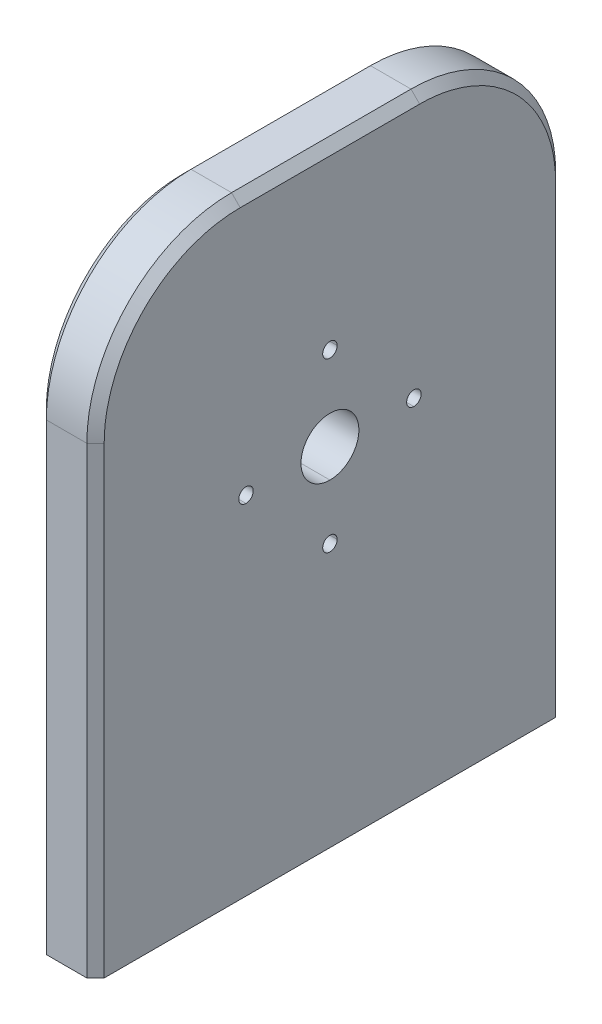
ISO-10303-21;
HEADER;
FILE_DESCRIPTION(('STEP AP214'),'2;1');
FILE_NAME('part.step','',(''),(''),'','','');
FILE_SCHEMA(('AUTOMOTIVE_DESIGN { 1 0 10303 214 1 1 1 1 }'));
ENDSEC;
DATA;
#1=APPLICATION_CONTEXT('core data for automotive mechanical design processes');
#2=APPLICATION_PROTOCOL_DEFINITION('international standard','automotive_design',2000,#1);
#3=PRODUCT_CONTEXT('',#1,'mechanical');
#4=PRODUCT('Part','Part','',(#3));
#5=PRODUCT_RELATED_PRODUCT_CATEGORY('part','',(#4));
#6=PRODUCT_DEFINITION_FORMATION('','',#4);
#7=PRODUCT_DEFINITION_CONTEXT('part definition',#1,'design');
#8=PRODUCT_DEFINITION('design','',#6,#7);
#9=PRODUCT_DEFINITION_SHAPE('','',#8);
#10=(LENGTH_UNIT() NAMED_UNIT(*) SI_UNIT(.MILLI.,.METRE.));
#11=(NAMED_UNIT(*) PLANE_ANGLE_UNIT() SI_UNIT($,.RADIAN.));
#12=(NAMED_UNIT(*) SI_UNIT($,.STERADIAN.) SOLID_ANGLE_UNIT());
#13=UNCERTAINTY_MEASURE_WITH_UNIT(LENGTH_MEASURE(1.E-05),#10,'distance_accuracy_value','');
#14=(GEOMETRIC_REPRESENTATION_CONTEXT(3) GLOBAL_UNCERTAINTY_ASSIGNED_CONTEXT((#13)) GLOBAL_UNIT_ASSIGNED_CONTEXT((#10,
#11,#12)) REPRESENTATION_CONTEXT('',''));
#15=CARTESIAN_POINT('',(0.,0.,0.));
#16=DIRECTION('',(0.,0.,1.));
#17=DIRECTION('',(1.,0.,0.));
#18=AXIS2_PLACEMENT_3D('',#15,#16,#17);
#19=CARTESIAN_POINT('',(0.,-26.79002077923,-22.5));
#20=DIRECTION('',(0.,-1.,0.));
#21=DIRECTION('',(-1.,0.,0.));
#22=AXIS2_PLACEMENT_3D('',#19,#20,#21);
#23=CONICAL_SURFACE('',#22,1.31839614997,1.02974425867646);
#24=CARTESIAN_POINT('',(0.,-27.5000000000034,-22.5));
#25=DIRECTION('',(0.,-1.,0.));
#26=DIRECTION('',(1.,0.,0.));
#27=AXIS2_PLACEMENT_3D('',#24,#25,#26);
#28=CIRCLE('',#27,2.49999999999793);
#29=CARTESIAN_POINT('',(2.49999999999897,-27.5000000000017,-22.5));
#30=VERTEX_POINT('',#29);
#31=CARTESIAN_POINT('',(-2.49999999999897,-27.5000000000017,-22.5));
#32=VERTEX_POINT('',#31);
#33=EDGE_CURVE('P0_E229',#30,#32,#28,.T.);
#34=ORIENTED_EDGE('',*,*,#33,.T.);
#35=CARTESIAN_POINT('',(-2.49999999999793,-27.5000000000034,-22.5));
#36=DIRECTION('',(0.857167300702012,0.515038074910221,0.));
#37=VECTOR('',#36,1.);
#38=LINE('',#35,#37);
#39=CARTESIAN_POINT('',(0.,-25.9978484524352,-22.5));
#40=VERTEX_POINT('',#39);
#41=EDGE_CURVE('P0_E223',#32,#40,#38,.T.);
#42=ORIENTED_EDGE('',*,*,#41,.T.);
#43=CARTESIAN_POINT('',(0.,-25.9978484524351,-22.5));
#44=DIRECTION('',(0.857167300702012,-0.515038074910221,0.));
#45=VECTOR('',#44,1.);
#46=LINE('',#43,#45);
#47=EDGE_CURVE('P0_E226',#40,#30,#46,.T.);
#48=ORIENTED_EDGE('',*,*,#47,.T.);
#49=EDGE_LOOP('',(#34,#42,#48));
#50=FACE_BOUND('',#49,.T.);
#51=ADVANCED_FACE('P0_F16',(#50),#23,.F.);
#52=CARTESIAN_POINT('',(0.,-26.79002077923,-22.5));
#53=DIRECTION('',(0.,-1.,0.));
#54=DIRECTION('',(-1.,0.,0.));
#55=AXIS2_PLACEMENT_3D('',#52,#53,#54);
#56=CONICAL_SURFACE('',#55,1.31839614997,1.02974425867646);
#57=ORIENTED_EDGE('',*,*,#47,.F.);
#58=ORIENTED_EDGE('',*,*,#41,.F.);
#59=CARTESIAN_POINT('',(0.,-27.5000000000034,-22.5));
#60=DIRECTION('',(0.,-1.,0.));
#61=DIRECTION('',(-1.,0.,0.));
#62=AXIS2_PLACEMENT_3D('',#59,#60,#61);
#63=CIRCLE('',#62,2.49999999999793);
#64=EDGE_CURVE('P0_E240',#32,#30,#63,.T.);
#65=ORIENTED_EDGE('',*,*,#64,.T.);
#66=EDGE_LOOP('',(#57,#58,#65));
#67=FACE_BOUND('',#66,.T.);
#68=ADVANCED_FACE('P0_F239',(#67),#56,.F.);
#69=CARTESIAN_POINT('',(0.,-26.79002077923,22.5));
#70=DIRECTION('',(0.,-1.,0.));
#71=DIRECTION('',(-1.,0.,0.));
#72=AXIS2_PLACEMENT_3D('',#69,#70,#71);
#73=CONICAL_SURFACE('',#72,1.31839614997,1.02974425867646);
#74=CARTESIAN_POINT('',(0.,-27.5000000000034,22.5));
#75=DIRECTION('',(0.,-1.,0.));
#76=DIRECTION('',(1.,0.,0.));
#77=AXIS2_PLACEMENT_3D('',#74,#75,#76);
#78=CIRCLE('',#77,2.49999999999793);
#79=CARTESIAN_POINT('',(2.49999999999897,-27.5000000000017,22.5));
#80=VERTEX_POINT('',#79);
#81=CARTESIAN_POINT('',(-2.49999999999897,-27.5000000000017,22.5));
#82=VERTEX_POINT('',#81);
#83=EDGE_CURVE('P0_E303',#80,#82,#78,.T.);
#84=ORIENTED_EDGE('',*,*,#83,.T.);
#85=CARTESIAN_POINT('',(-2.49999999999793,-27.5000000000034,22.5));
#86=DIRECTION('',(0.857167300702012,0.515038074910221,0.));
#87=VECTOR('',#86,1.);
#88=LINE('',#85,#87);
#89=CARTESIAN_POINT('',(0.,-25.9978484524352,22.5));
#90=VERTEX_POINT('',#89);
#91=EDGE_CURVE('P0_E243',#82,#90,#88,.T.);
#92=ORIENTED_EDGE('',*,*,#91,.T.);
#93=CARTESIAN_POINT('',(0.,-25.9978484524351,22.5));
#94=DIRECTION('',(0.857167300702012,-0.515038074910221,0.));
#95=VECTOR('',#94,1.);
#96=LINE('',#93,#95);
#97=EDGE_CURVE('P0_E293',#90,#80,#96,.T.);
#98=ORIENTED_EDGE('',*,*,#97,.T.);
#99=EDGE_LOOP('',(#84,#92,#98));
#100=FACE_BOUND('',#99,.T.);
#101=ADVANCED_FACE('P0_F258',(#100),#73,.F.);
#102=CARTESIAN_POINT('',(0.,-26.79002077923,22.5));
#103=DIRECTION('',(0.,-1.,0.));
#104=DIRECTION('',(-1.,0.,0.));
#105=AXIS2_PLACEMENT_3D('',#102,#103,#104);
#106=CONICAL_SURFACE('',#105,1.31839614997,1.02974425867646);
#107=ORIENTED_EDGE('',*,*,#97,.F.);
#108=ORIENTED_EDGE('',*,*,#91,.F.);
#109=CARTESIAN_POINT('',(0.,-27.5000000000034,22.5));
#110=DIRECTION('',(0.,-1.,0.));
#111=DIRECTION('',(-1.,0.,0.));
#112=AXIS2_PLACEMENT_3D('',#109,#110,#111);
#113=CIRCLE('',#112,2.49999999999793);
#114=EDGE_CURVE('P0_E311',#82,#80,#113,.T.);
#115=ORIENTED_EDGE('',*,*,#114,.T.);
#116=EDGE_LOOP('',(#107,#108,#115));
#117=FACE_BOUND('',#116,.T.);
#118=ADVANCED_FACE('P0_F271',(#117),#106,.F.);
#119=CARTESIAN_POINT('',(0.,-36.94023593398,34.5));
#120=DIRECTION('',(0.,-1.,0.));
#121=DIRECTION('',(-1.,0.,0.));
#122=AXIS2_PLACEMENT_3D('',#119,#120,#121);
#123=CONICAL_SURFACE('',#122,1.06839614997,1.02974425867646);
#124=CARTESIAN_POINT('',(0.,-37.4999999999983,34.5));
#125=DIRECTION('',(0.,-1.,0.));
#126=DIRECTION('',(1.,0.,0.));
#127=AXIS2_PLACEMENT_3D('',#124,#125,#126);
#128=CIRCLE('',#127,2.000000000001);
#129=CARTESIAN_POINT('',(2.0000000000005,-37.4999999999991,34.5));
#130=VERTEX_POINT('',#129);
#131=CARTESIAN_POINT('',(-2.0000000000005,-37.4999999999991,34.5));
#132=VERTEX_POINT('',#131);
#133=EDGE_CURVE('P0_E340',#130,#132,#128,.T.);
#134=ORIENTED_EDGE('',*,*,#133,.T.);
#135=CARTESIAN_POINT('',(-2.000000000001,-37.4999999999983,34.5));
#136=DIRECTION('',(0.857167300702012,0.51503807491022,0.));
#137=VECTOR('',#136,1.);
#138=LINE('',#135,#137);
#139=CARTESIAN_POINT('',(0.,-36.2982787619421,34.5));
#140=VERTEX_POINT('',#139);
#141=EDGE_CURVE('P0_E309',#132,#140,#138,.T.);
#142=ORIENTED_EDGE('',*,*,#141,.T.);
#143=CARTESIAN_POINT('',(0.,-36.2982787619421,34.5));
#144=DIRECTION('',(0.857167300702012,-0.51503807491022,0.));
#145=VECTOR('',#144,1.);
#146=LINE('',#143,#145);
#147=EDGE_CURVE('P0_E1134',#140,#130,#146,.T.);
#148=ORIENTED_EDGE('',*,*,#147,.T.);
#149=EDGE_LOOP('',(#134,#142,#148));
#150=FACE_BOUND('',#149,.T.);
#151=ADVANCED_FACE('P0_F1157',(#150),#123,.F.);
#152=CARTESIAN_POINT('',(0.,-36.94023593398,34.5));
#153=DIRECTION('',(0.,-1.,0.));
#154=DIRECTION('',(-1.,0.,0.));
#155=AXIS2_PLACEMENT_3D('',#152,#153,#154);
#156=CONICAL_SURFACE('',#155,1.06839614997,1.02974425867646);
#157=ORIENTED_EDGE('',*,*,#147,.F.);
#158=ORIENTED_EDGE('',*,*,#141,.F.);
#159=CARTESIAN_POINT('',(0.,-37.4999999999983,34.5));
#160=DIRECTION('',(0.,-1.,0.));
#161=DIRECTION('',(-1.,0.,0.));
#162=AXIS2_PLACEMENT_3D('',#159,#160,#161);
#163=CIRCLE('',#162,2.000000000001);
#164=EDGE_CURVE('P0_E1071',#132,#130,#163,.T.);
#165=ORIENTED_EDGE('',*,*,#164,.T.);
#166=EDGE_LOOP('',(#157,#158,#165));
#167=FACE_BOUND('',#166,.T.);
#168=ADVANCED_FACE('P0_F1132',(#167),#156,.F.);
#169=CARTESIAN_POINT('',(0.,-36.94023593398,-34.5));
#170=DIRECTION('',(0.,-1.,0.));
#171=DIRECTION('',(-1.,0.,0.));
#172=AXIS2_PLACEMENT_3D('',#169,#170,#171);
#173=CONICAL_SURFACE('',#172,1.06839614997,1.02974425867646);
#174=CARTESIAN_POINT('',(0.,-37.4999999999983,-34.5));
#175=DIRECTION('',(0.,-1.,0.));
#176=DIRECTION('',(1.,0.,0.));
#177=AXIS2_PLACEMENT_3D('',#174,#175,#176);
#178=CIRCLE('',#177,2.000000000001);
#179=CARTESIAN_POINT('',(2.0000000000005,-37.4999999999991,-34.5));
#180=VERTEX_POINT('',#179);
#181=CARTESIAN_POINT('',(-2.0000000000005,-37.4999999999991,-34.5));
#182=VERTEX_POINT('',#181);
#183=EDGE_CURVE('P0_E1343',#180,#182,#178,.T.);
#184=ORIENTED_EDGE('',*,*,#183,.T.);
#185=CARTESIAN_POINT('',(-2.000000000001,-37.4999999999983,-34.5));
#186=DIRECTION('',(0.857167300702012,0.51503807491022,0.));
#187=VECTOR('',#186,1.);
#188=LINE('',#185,#187);
#189=CARTESIAN_POINT('',(0.,-36.2982787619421,-34.5));
#190=VERTEX_POINT('',#189);
#191=EDGE_CURVE('P0_E1220',#182,#190,#188,.T.);
#192=ORIENTED_EDGE('',*,*,#191,.T.);
#193=CARTESIAN_POINT('',(0.,-36.2982787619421,-34.5));
#194=DIRECTION('',(0.857167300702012,-0.51503807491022,0.));
#195=VECTOR('',#194,1.);
#196=LINE('',#193,#195);
#197=EDGE_CURVE('P0_E1225',#190,#180,#196,.T.);
#198=ORIENTED_EDGE('',*,*,#197,.T.);
#199=EDGE_LOOP('',(#184,#192,#198));
#200=FACE_BOUND('',#199,.T.);
#201=ADVANCED_FACE('P0_F1156',(#200),#173,.F.);
#202=CARTESIAN_POINT('',(0.,-36.94023593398,-34.5));
#203=DIRECTION('',(0.,-1.,0.));
#204=DIRECTION('',(-1.,0.,0.));
#205=AXIS2_PLACEMENT_3D('',#202,#203,#204);
#206=CONICAL_SURFACE('',#205,1.06839614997,1.02974425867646);
#207=ORIENTED_EDGE('',*,*,#197,.F.);
#208=ORIENTED_EDGE('',*,*,#191,.F.);
#209=CARTESIAN_POINT('',(0.,-37.4999999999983,-34.5));
#210=DIRECTION('',(0.,-1.,0.));
#211=DIRECTION('',(-1.,0.,0.));
#212=AXIS2_PLACEMENT_3D('',#209,#210,#211);
#213=CIRCLE('',#212,2.000000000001);
#214=EDGE_CURVE('P0_E980',#182,#180,#213,.T.);
#215=ORIENTED_EDGE('',*,*,#214,.T.);
#216=EDGE_LOOP('',(#207,#208,#215));
#217=FACE_BOUND('',#216,.T.);
#218=ADVANCED_FACE('P0_F1768',(#217),#206,.F.);
#219=CARTESIAN_POINT('',(0.,-24.67274087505,-22.5));
#220=DIRECTION('',(0.,-1.,0.));
#221=DIRECTION('',(-1.,0.,0.));
#222=AXIS2_PLACEMENT_3D('',#219,#220,#221);
#223=CYLINDRICAL_SURFACE('',#222,2.5);
#224=ORIENTED_EDGE('',*,*,#33,.F.);
#225=CARTESIAN_POINT('',(2.5,-27.5,-22.5));
#226=DIRECTION('',(0.,-1.,0.));
#227=VECTOR('',#226,1.);
#228=LINE('',#225,#227);
#229=CARTESIAN_POINT('',(2.5,-52.5,-22.5));
#230=VERTEX_POINT('',#229);
#231=EDGE_CURVE('P0_E330',#30,#230,#228,.T.);
#232=ORIENTED_EDGE('',*,*,#231,.T.);
#233=CARTESIAN_POINT('',(-2.5,-52.5,-22.5));
#234=CARTESIAN_POINT('',(-2.5,-52.5,-22.0030051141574));
#235=CARTESIAN_POINT('',(-2.30969883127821,-52.5,-21.5432914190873));
#236=CARTESIAN_POINT('',(-2.11970910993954,-52.5,-21.0843300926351));
#237=CARTESIAN_POINT('',(-1.76776695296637,-52.5,-20.7322330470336));
#238=CARTESIAN_POINT('',(-1.41660244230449,-52.5,-20.3809139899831));
#239=CARTESIAN_POINT('',(-0.956708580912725,-52.5,-20.1903011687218));
#240=CARTESIAN_POINT('',(-0.49783089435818,-52.5,-20.0001095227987));
#241=CARTESIAN_POINT('',(0.,-52.5,-20.));
#242=CARTESIAN_POINT('',(0.49673089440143,-52.5,-19.9998907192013));
#243=CARTESIAN_POINT('',(0.95670858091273,-52.5,-20.1903011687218));
#244=CARTESIAN_POINT('',(1.41566990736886,-52.5,-20.3802908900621));
#245=CARTESIAN_POINT('',(1.76776695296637,-52.5,-20.7322330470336));
#246=CARTESIAN_POINT('',(2.11908601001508,-52.5,-21.0833975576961));
#247=CARTESIAN_POINT('',(2.30969883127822,-52.5,-21.5432914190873));
#248=CARTESIAN_POINT('',(2.5,-52.5,-22.0024333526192));
#249=CARTESIAN_POINT('',(2.5,-52.5,-22.5));
#250=B_SPLINE_CURVE_WITH_KNOTS('',2,(#233,#234,#235,#236,#237,#238,#239,#240,#241,#242,#243,
#244,#245,#246,#247,#248,#249),.UNSPECIFIED.,.F.,.F.,(3,2,2,2,2,2,2,2,3),(0.,0.125,0.25,0.375,
0.5,0.625,0.75,0.875,1.),.UNSPECIFIED.);
#251=CARTESIAN_POINT('',(-2.5,-52.5,-22.5));
#252=VERTEX_POINT('',#251);
#253=EDGE_CURVE('P0_E1257',#252,#230,#250,.T.);
#254=ORIENTED_EDGE('',*,*,#253,.F.);
#255=CARTESIAN_POINT('',(-2.5,-52.5,-22.5));
#256=DIRECTION('',(0.,1.,0.));
#257=VECTOR('',#256,1.);
#258=LINE('',#255,#257);
#259=EDGE_CURVE('P0_E1235',#252,#32,#258,.T.);
#260=ORIENTED_EDGE('',*,*,#259,.T.);
#261=EDGE_LOOP('',(#224,#232,#254,#260));
#262=FACE_BOUND('',#261,.T.);
#263=ADVANCED_FACE('P0_F1255',(#262),#223,.F.);
#264=CARTESIAN_POINT('',(0.,-24.67274087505,-22.5));
#265=DIRECTION('',(0.,-1.,0.));
#266=DIRECTION('',(-1.,0.,0.));
#267=AXIS2_PLACEMENT_3D('',#264,#265,#266);
#268=CYLINDRICAL_SURFACE('',#267,2.5);
#269=ORIENTED_EDGE('',*,*,#64,.F.);
#270=ORIENTED_EDGE('',*,*,#259,.F.);
#271=CARTESIAN_POINT('',(2.5,-52.5,-22.5));
#272=CARTESIAN_POINT('',(2.5,-52.5,-22.9969948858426));
#273=CARTESIAN_POINT('',(2.30969883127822,-52.5,-23.4567085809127));
#274=CARTESIAN_POINT('',(2.11970910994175,-52.5,-23.9156699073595));
#275=CARTESIAN_POINT('',(1.76776695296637,-52.5,-24.2677669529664));
#276=CARTESIAN_POINT('',(1.41660244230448,-52.5,-24.61908601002));
#277=CARTESIAN_POINT('',(0.95670858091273,-52.5,-24.8096988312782));
#278=CARTESIAN_POINT('',(0.497830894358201,-52.5,-24.9998904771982));
#279=CARTESIAN_POINT('',(0.,-52.5,-25.));
#280=CARTESIAN_POINT('',(-0.49673089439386,-52.5,-25.0001092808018));
#281=CARTESIAN_POINT('',(-0.956708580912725,-52.5,-24.8096988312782));
#282=CARTESIAN_POINT('',(-1.41566990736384,-52.5,-24.61970910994));
#283=CARTESIAN_POINT('',(-1.76776695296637,-52.5,-24.2677669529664));
#284=CARTESIAN_POINT('',(-2.11908601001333,-52.5,-23.9166024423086));
#285=CARTESIAN_POINT('',(-2.30969883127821,-52.5,-23.4567085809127));
#286=CARTESIAN_POINT('',(-2.5,-52.5,-22.9975666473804));
#287=CARTESIAN_POINT('',(-2.5,-52.5,-22.5));
#288=B_SPLINE_CURVE_WITH_KNOTS('',2,(#271,#272,#273,#274,#275,#276,#277,#278,#279,#280,#281,
#282,#283,#284,#285,#286,#287),.UNSPECIFIED.,.F.,.F.,(3,2,2,2,2,2,2,2,3),(0.,0.125,0.25,0.375,
0.5,0.625,0.75,0.875,1.),.UNSPECIFIED.);
#289=EDGE_CURVE('P0_E1265',#230,#252,#288,.T.);
#290=ORIENTED_EDGE('',*,*,#289,.F.);
#291=ORIENTED_EDGE('',*,*,#231,.F.);
#292=EDGE_LOOP('',(#269,#270,#290,#291));
#293=FACE_BOUND('',#292,.T.);
#294=ADVANCED_FACE('P0_F1267',(#293),#268,.F.);
#295=CARTESIAN_POINT('',(0.,-24.67274087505,22.5));
#296=DIRECTION('',(0.,-1.,0.));
#297=DIRECTION('',(-1.,0.,0.));
#298=AXIS2_PLACEMENT_3D('',#295,#296,#297);
#299=CYLINDRICAL_SURFACE('',#298,2.5);
#300=ORIENTED_EDGE('',*,*,#83,.F.);
#301=CARTESIAN_POINT('',(2.5,-27.5,22.5));
#302=DIRECTION('',(0.,-1.,0.));
#303=VECTOR('',#302,1.);
#304=LINE('',#301,#303);
#305=CARTESIAN_POINT('',(2.5,-52.5,22.5));
#306=VERTEX_POINT('',#305);
#307=EDGE_CURVE('P0_E319',#80,#306,#304,.T.);
#308=ORIENTED_EDGE('',*,*,#307,.T.);
#309=CARTESIAN_POINT('',(-2.5,-52.5,22.5));
#310=CARTESIAN_POINT('',(-2.5,-52.5,22.9969948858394));
#311=CARTESIAN_POINT('',(-2.30969883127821,-52.5,23.4567085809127));
#312=CARTESIAN_POINT('',(-2.11970910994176,-52.5,23.9156699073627));
#313=CARTESIAN_POINT('',(-1.76776695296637,-52.5,24.2677669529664));
#314=CARTESIAN_POINT('',(-1.41660244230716,-52.5,24.6190860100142));
#315=CARTESIAN_POINT('',(-0.956708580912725,-52.5,24.8096988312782));
#316=CARTESIAN_POINT('',(-0.49783089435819,-52.5,24.9998904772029));
#317=CARTESIAN_POINT('',(0.,-52.5,25.));
#318=CARTESIAN_POINT('',(0.49673089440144,-52.5,25.0001092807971));
#319=CARTESIAN_POINT('',(0.95670858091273,-52.5,24.8096988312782));
#320=CARTESIAN_POINT('',(1.41566990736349,-52.5,24.6197091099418));
#321=CARTESIAN_POINT('',(1.76776695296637,-52.5,24.2677669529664));
#322=CARTESIAN_POINT('',(2.11908601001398,-52.5,23.9166024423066));
#323=CARTESIAN_POINT('',(2.30969883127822,-52.5,23.4567085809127));
#324=CARTESIAN_POINT('',(2.5,-52.5,22.9975666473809));
#325=CARTESIAN_POINT('',(2.5,-52.5,22.5));
#326=B_SPLINE_CURVE_WITH_KNOTS('',2,(#309,#310,#311,#312,#313,#314,#315,#316,#317,#318,#319,
#320,#321,#322,#323,#324,#325),.UNSPECIFIED.,.F.,.F.,(3,2,2,2,2,2,2,2,3),(0.,0.125,0.25,0.375,
0.5,0.625,0.75,0.875,1.),.UNSPECIFIED.);
#327=CARTESIAN_POINT('',(-2.5,-52.5,22.5));
#328=VERTEX_POINT('',#327);
#329=EDGE_CURVE('P0_E384',#328,#306,#326,.T.);
#330=ORIENTED_EDGE('',*,*,#329,.F.);
#331=CARTESIAN_POINT('',(-2.5,-52.5,22.5));
#332=DIRECTION('',(0.,1.,0.));
#333=VECTOR('',#332,1.);
#334=LINE('',#331,#333);
#335=EDGE_CURVE('P0_E320',#328,#82,#334,.T.);
#336=ORIENTED_EDGE('',*,*,#335,.T.);
#337=EDGE_LOOP('',(#300,#308,#330,#336));
#338=FACE_BOUND('',#337,.T.);
#339=ADVANCED_FACE('P0_F325',(#338),#299,.F.);
#340=CARTESIAN_POINT('',(0.,-24.67274087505,22.5));
#341=DIRECTION('',(0.,-1.,0.));
#342=DIRECTION('',(-1.,0.,0.));
#343=AXIS2_PLACEMENT_3D('',#340,#341,#342);
#344=CYLINDRICAL_SURFACE('',#343,2.5);
#345=ORIENTED_EDGE('',*,*,#114,.F.);
#346=ORIENTED_EDGE('',*,*,#335,.F.);
#347=CARTESIAN_POINT('',(2.5,-52.5,22.5));
#348=CARTESIAN_POINT('',(2.5,-52.5,22.0030051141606));
#349=CARTESIAN_POINT('',(2.30969883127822,-52.5,21.5432914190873));
#350=CARTESIAN_POINT('',(2.11970910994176,-52.5,21.0843300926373));
#351=CARTESIAN_POINT('',(1.76776695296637,-52.5,20.7322330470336));
#352=CARTESIAN_POINT('',(1.41660244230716,-52.5,20.3809139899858));
#353=CARTESIAN_POINT('',(0.95670858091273,-52.5,20.1903011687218));
#354=CARTESIAN_POINT('',(0.49783089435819,-52.5,20.0001095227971));
#355=CARTESIAN_POINT('',(0.,-52.5,20.));
#356=CARTESIAN_POINT('',(-0.49673089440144,-52.5,19.9998907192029));
#357=CARTESIAN_POINT('',(-0.956708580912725,-52.5,20.1903011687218));
#358=CARTESIAN_POINT('',(-1.41566990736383,-52.5,20.3802908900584));
#359=CARTESIAN_POINT('',(-1.76776695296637,-52.5,20.7322330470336));
#360=CARTESIAN_POINT('',(-2.11908601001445,-52.5,21.0833975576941));
#361=CARTESIAN_POINT('',(-2.30969883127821,-52.5,21.5432914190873));
#362=CARTESIAN_POINT('',(-2.5,-52.5,22.0024333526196));
#363=CARTESIAN_POINT('',(-2.5,-52.5,22.5));
#364=B_SPLINE_CURVE_WITH_KNOTS('',2,(#347,#348,#349,#350,#351,#352,#353,#354,#355,#356,#357,
#358,#359,#360,#361,#362,#363),.UNSPECIFIED.,.F.,.F.,(3,2,2,2,2,2,2,2,3),(0.,0.125,0.25,0.375,
0.5,0.625,0.75,0.875,1.),.UNSPECIFIED.);
#365=EDGE_CURVE('P0_E336',#306,#328,#364,.T.);
#366=ORIENTED_EDGE('',*,*,#365,.F.);
#367=ORIENTED_EDGE('',*,*,#307,.F.);
#368=EDGE_LOOP('',(#345,#346,#366,#367));
#369=FACE_BOUND('',#368,.T.);
#370=ADVANCED_FACE('P0_F334',(#369),#344,.F.);
#371=CARTESIAN_POINT('',(0.,-35.48819270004,34.5));
#372=DIRECTION('',(0.,-1.,0.));
#373=DIRECTION('',(-1.,0.,0.));
#374=AXIS2_PLACEMENT_3D('',#371,#372,#373);
#375=CYLINDRICAL_SURFACE('',#374,2.);
#376=ORIENTED_EDGE('',*,*,#133,.F.);
#377=CARTESIAN_POINT('',(2.,-37.5,34.5));
#378=DIRECTION('',(0.,-1.,0.));
#379=VECTOR('',#378,1.);
#380=LINE('',#377,#379);
#381=CARTESIAN_POINT('',(2.,-52.5,34.5));
#382=VERTEX_POINT('',#381);
#383=EDGE_CURVE('P0_E1081',#130,#382,#380,.T.);
#384=ORIENTED_EDGE('',*,*,#383,.T.);
#385=CARTESIAN_POINT('',(-2.,-52.5,34.5));
#386=CARTESIAN_POINT('',(-2.,-52.5,34.8975386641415));
#387=CARTESIAN_POINT('',(-1.84775906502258,-52.5,35.2653668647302));
#388=CARTESIAN_POINT('',(-1.69582955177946,-52.5,35.6324426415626));
#389=CARTESIAN_POINT('',(-1.41421356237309,-52.5,35.9142135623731));
#390=CARTESIAN_POINT('',(-1.13337517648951,-52.5,36.1952064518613));
#391=CARTESIAN_POINT('',(-0.76536686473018,-52.5,36.3477590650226));
#392=CARTESIAN_POINT('',(-0.39837470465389,-52.5,36.4998904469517));
#393=CARTESIAN_POINT('',(0.,-52.5,36.5));
#394=CARTESIAN_POINT('',(0.39727470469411,-52.5,36.5001092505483));
#395=CARTESIAN_POINT('',(0.76536686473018,-52.5,36.3477590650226));
#396=CARTESIAN_POINT('',(1.13244264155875,-52.5,36.1958295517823));
#397=CARTESIAN_POINT('',(1.41421356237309,-52.5,35.9142135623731));
#398=CARTESIAN_POINT('',(1.69520645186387,-52.5,35.6333751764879));
#399=CARTESIAN_POINT('',(1.84775906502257,-52.5,35.2653668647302));
#400=CARTESIAN_POINT('',(2.,-52.5,34.8981104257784));
#401=CARTESIAN_POINT('',(2.,-52.5,34.5));
#402=B_SPLINE_CURVE_WITH_KNOTS('',2,(#385,#386,#387,#388,#389,#390,#391,#392,#393,#394,#395,
#396,#397,#398,#399,#400,#401),.UNSPECIFIED.,.F.,.F.,(3,2,2,2,2,2,2,2,3),(0.,0.125,0.25,0.375,
0.5,0.625,0.75,0.875,1.),.UNSPECIFIED.);
#403=CARTESIAN_POINT('',(-2.,-52.5,34.5));
#404=VERTEX_POINT('',#403);
#405=EDGE_CURVE('P0_E387',#404,#382,#402,.T.);
#406=ORIENTED_EDGE('',*,*,#405,.F.);
#407=CARTESIAN_POINT('',(-2.,-52.5,34.5));
#408=DIRECTION('',(0.,1.,0.));
#409=VECTOR('',#408,1.);
#410=LINE('',#407,#409);
#411=EDGE_CURVE('P0_E1060',#404,#132,#410,.T.);
#412=ORIENTED_EDGE('',*,*,#411,.T.);
#413=EDGE_LOOP('',(#376,#384,#406,#412));
#414=FACE_BOUND('',#413,.T.);
#415=ADVANCED_FACE('P0_F359',(#414),#375,.F.);
#416=CARTESIAN_POINT('',(0.,-35.48819270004,34.5));
#417=DIRECTION('',(0.,-1.,0.));
#418=DIRECTION('',(-1.,0.,0.));
#419=AXIS2_PLACEMENT_3D('',#416,#417,#418);
#420=CYLINDRICAL_SURFACE('',#419,2.);
#421=ORIENTED_EDGE('',*,*,#164,.F.);
#422=ORIENTED_EDGE('',*,*,#411,.F.);
#423=CARTESIAN_POINT('',(2.,-52.5,34.5));
#424=CARTESIAN_POINT('',(2.,-52.5,34.1024613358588));
#425=CARTESIAN_POINT('',(1.84775906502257,-52.5,33.7346331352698));
#426=CARTESIAN_POINT('',(1.69582955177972,-52.5,33.3675573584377));
#427=CARTESIAN_POINT('',(1.4142135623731,-52.5,33.0857864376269));
#428=CARTESIAN_POINT('',(1.1333751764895,-52.5,32.8047935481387));
#429=CARTESIAN_POINT('',(0.76536686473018,-52.5,32.6522409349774));
#430=CARTESIAN_POINT('',(0.39837470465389,-52.5,32.5001095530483));
#431=CARTESIAN_POINT('',(0.,-52.5,32.5));
#432=CARTESIAN_POINT('',(-0.39727470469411,-52.5,32.4998907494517));
#433=CARTESIAN_POINT('',(-0.76536686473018,-52.5,32.6522409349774));
#434=CARTESIAN_POINT('',(-1.13244264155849,-52.5,32.8041704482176));
#435=CARTESIAN_POINT('',(-1.41421356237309,-52.5,33.0857864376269));
#436=CARTESIAN_POINT('',(-1.69520645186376,-52.5,33.3666248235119));
#437=CARTESIAN_POINT('',(-1.84775906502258,-52.5,33.7346331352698));
#438=CARTESIAN_POINT('',(-2.,-52.5,34.1018895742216));
#439=CARTESIAN_POINT('',(-2.,-52.5,34.5));
#440=B_SPLINE_CURVE_WITH_KNOTS('',2,(#423,#424,#425,#426,#427,#428,#429,#430,#431,#432,#433,
#434,#435,#436,#437,#438,#439),.UNSPECIFIED.,.F.,.F.,(3,2,2,2,2,2,2,2,3),(0.,0.125,0.25,0.375,
0.5,0.625,0.75,0.875,1.),.UNSPECIFIED.);
#441=EDGE_CURVE('P0_E1048',#382,#404,#440,.T.);
#442=ORIENTED_EDGE('',*,*,#441,.F.);
#443=ORIENTED_EDGE('',*,*,#383,.F.);
#444=EDGE_LOOP('',(#421,#422,#442,#443));
#445=FACE_BOUND('',#444,.T.);
#446=ADVANCED_FACE('P0_F1014',(#445),#420,.F.);
#447=CARTESIAN_POINT('',(0.,-35.48819270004,-34.5));
#448=DIRECTION('',(0.,-1.,0.));
#449=DIRECTION('',(-1.,0.,0.));
#450=AXIS2_PLACEMENT_3D('',#447,#448,#449);
#451=CYLINDRICAL_SURFACE('',#450,2.);
#452=ORIENTED_EDGE('',*,*,#183,.F.);
#453=CARTESIAN_POINT('',(2.,-37.5,-34.5));
#454=DIRECTION('',(0.,-1.,0.));
#455=VECTOR('',#454,1.);
#456=LINE('',#453,#455);
#457=CARTESIAN_POINT('',(2.,-52.5,-34.5));
#458=VERTEX_POINT('',#457);
#459=EDGE_CURVE('P0_E990',#180,#458,#456,.T.);
#460=ORIENTED_EDGE('',*,*,#459,.T.);
#461=CARTESIAN_POINT('',(-2.,-52.5,-34.5));
#462=CARTESIAN_POINT('',(-2.,-52.5,-34.1024613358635));
#463=CARTESIAN_POINT('',(-1.84775906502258,-52.5,-33.7346331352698));
#464=CARTESIAN_POINT('',(-1.695829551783,-52.5,-33.367557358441));
#465=CARTESIAN_POINT('',(-1.41421356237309,-52.5,-33.0857864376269));
#466=CARTESIAN_POINT('',(-1.13337517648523,-52.5,-32.8047935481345));
#467=CARTESIAN_POINT('',(-0.76536686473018,-52.5,-32.6522409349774));
#468=CARTESIAN_POINT('',(-0.39837470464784,-52.5,-32.5001095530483));
#469=CARTESIAN_POINT('',(0.,-52.5,-32.5));
#470=CARTESIAN_POINT('',(0.397274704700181,-52.5,-32.4998907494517));
#471=CARTESIAN_POINT('',(0.76536686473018,-52.5,-32.6522409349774));
#472=CARTESIAN_POINT('',(1.13244264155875,-52.5,-32.8041704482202));
#473=CARTESIAN_POINT('',(1.41421356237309,-52.5,-33.0857864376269));
#474=CARTESIAN_POINT('',(1.69520645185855,-52.5,-33.3666248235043));
#475=CARTESIAN_POINT('',(1.84775906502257,-52.5,-33.7346331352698));
#476=CARTESIAN_POINT('',(2.,-52.5,-34.1018895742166));
#477=CARTESIAN_POINT('',(2.,-52.5,-34.5));
#478=B_SPLINE_CURVE_WITH_KNOTS('',2,(#461,#462,#463,#464,#465,#466,#467,#468,#469,#470,#471,
#472,#473,#474,#475,#476,#477),.UNSPECIFIED.,.F.,.F.,(3,2,2,2,2,2,2,2,3),(0.,0.125,0.25,0.375,
0.5,0.625,0.75,0.875,1.),.UNSPECIFIED.);
#479=CARTESIAN_POINT('',(-2.,-52.5,-34.5));
#480=VERTEX_POINT('',#479);
#481=EDGE_CURVE('P0_E1001',#480,#458,#478,.T.);
#482=ORIENTED_EDGE('',*,*,#481,.F.);
#483=CARTESIAN_POINT('',(-2.,-52.5,-34.5));
#484=DIRECTION('',(0.,1.,0.));
#485=VECTOR('',#484,1.);
#486=LINE('',#483,#485);
#487=EDGE_CURVE('P0_E969',#480,#182,#486,.T.);
#488=ORIENTED_EDGE('',*,*,#487,.T.);
#489=EDGE_LOOP('',(#452,#460,#482,#488));
#490=FACE_BOUND('',#489,.T.);
#491=ADVANCED_FACE('P0_F1006',(#490),#451,.F.);
#492=CARTESIAN_POINT('',(0.,-35.48819270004,-34.5));
#493=DIRECTION('',(0.,-1.,0.));
#494=DIRECTION('',(-1.,0.,0.));
#495=AXIS2_PLACEMENT_3D('',#492,#493,#494);
#496=CYLINDRICAL_SURFACE('',#495,2.);
#497=ORIENTED_EDGE('',*,*,#214,.F.);
#498=ORIENTED_EDGE('',*,*,#487,.F.);
#499=CARTESIAN_POINT('',(2.,-52.5,-34.5));
#500=CARTESIAN_POINT('',(2.,-52.5,-34.8975386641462));
#501=CARTESIAN_POINT('',(1.84775906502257,-52.5,-35.2653668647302));
#502=CARTESIAN_POINT('',(1.69582955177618,-52.5,-35.6324426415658));
#503=CARTESIAN_POINT('',(1.4142135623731,-52.5,-35.9142135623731));
#504=CARTESIAN_POINT('',(1.13337517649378,-52.5,-36.195206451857));
#505=CARTESIAN_POINT('',(0.76536686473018,-52.5,-36.3477590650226));
#506=CARTESIAN_POINT('',(0.39837470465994,-52.5,-36.4998904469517));
#507=CARTESIAN_POINT('',(0.,-52.5,-36.5));
#508=CARTESIAN_POINT('',(-0.39727470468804,-52.5,-36.5001092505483));
#509=CARTESIAN_POINT('',(-0.76536686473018,-52.5,-36.3477590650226));
#510=CARTESIAN_POINT('',(-1.13244264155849,-52.5,-36.1958295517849));
#511=CARTESIAN_POINT('',(-1.41421356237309,-52.5,-35.9142135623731));
#512=CARTESIAN_POINT('',(-1.69520645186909,-52.5,-35.6333751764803));
#513=CARTESIAN_POINT('',(-1.84775906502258,-52.5,-35.2653668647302));
#514=CARTESIAN_POINT('',(-2.,-52.5,-34.8981104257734));
#515=CARTESIAN_POINT('',(-2.,-52.5,-34.5));
#516=B_SPLINE_CURVE_WITH_KNOTS('',2,(#499,#500,#501,#502,#503,#504,#505,#506,#507,#508,#509,
#510,#511,#512,#513,#514,#515),.UNSPECIFIED.,.F.,.F.,(3,2,2,2,2,2,2,2,3),(0.,0.125,0.25,0.375,
0.5,0.625,0.75,0.875,1.),.UNSPECIFIED.);
#517=EDGE_CURVE('P0_E489',#458,#480,#516,.T.);
#518=ORIENTED_EDGE('',*,*,#517,.F.);
#519=ORIENTED_EDGE('',*,*,#459,.F.);
#520=EDGE_LOOP('',(#497,#498,#518,#519));
#521=FACE_BOUND('',#520,.T.);
#522=ADVANCED_FACE('P0_F927',(#521),#496,.F.);
#523=CARTESIAN_POINT('',(-5.,-52.5,-40.5));
#524=DIRECTION('',(0.,0.,-1.));
#525=DIRECTION('',(0.,-1.,0.));
#526=AXIS2_PLACEMENT_3D('',#523,#524,#525);
#527=PLANE('',#526);
#528=CARTESIAN_POINT('',(-3.5,-52.5,-40.5));
#529=DIRECTION('',(1.,0.,0.));
#530=VECTOR('',#529,1.);
#531=LINE('',#528,#530);
#532=CARTESIAN_POINT('',(-3.5000000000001,-52.5,-40.5));
#533=VERTEX_POINT('',#532);
#534=CARTESIAN_POINT('',(3.5,-52.5,-40.5));
#535=VERTEX_POINT('',#534);
#536=EDGE_CURVE('P0_E1286',#533,#535,#531,.T.);
#537=ORIENTED_EDGE('',*,*,#536,.F.);
#538=CARTESIAN_POINT('',(-3.50000000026,27.4999999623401,-40.49999999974));
#539=DIRECTION('',(3.24636151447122E-12,-1.,-3.24636151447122E-12));
#540=VECTOR('',#539,1.);
#541=LINE('',#538,#540);
#542=CARTESIAN_POINT('',(-3.50000000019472,27.499999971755,-40.4999999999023));
#543=VERTEX_POINT('',#542);
#544=EDGE_CURVE('P0_E709',#543,#533,#541,.T.);
#545=ORIENTED_EDGE('',*,*,#544,.F.);
#546=CARTESIAN_POINT('',(3.5,27.49999996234,-40.5));
#547=DIRECTION('',(-1.,0.,0.));
#548=VECTOR('',#547,1.);
#549=LINE('',#546,#548);
#550=CARTESIAN_POINT('',(3.50000000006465,27.4999999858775,-40.4999999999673));
#551=VERTEX_POINT('',#550);
#552=EDGE_CURVE('P0_E892',#551,#543,#549,.T.);
#553=ORIENTED_EDGE('',*,*,#552,.F.);
#554=CARTESIAN_POINT('',(3.5,-52.5,-40.5));
#555=DIRECTION('',(3.246361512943E-12,1.,3.246361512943E-12));
#556=VECTOR('',#555,1.);
#557=LINE('',#554,#556);
#558=EDGE_CURVE('P0_E2196',#535,#551,#557,.T.);
#559=ORIENTED_EDGE('',*,*,#558,.F.);
#560=EDGE_LOOP('',(#537,#545,#553,#559));
#561=FACE_BOUND('',#560,.T.);
#562=ADVANCED_FACE('P0_F918',(#561),#527,.T.);
#563=CARTESIAN_POINT('',(36.072,27.5,-15.5));
#564=DIRECTION('',(-1.,0.,0.));
#565=DIRECTION('',(0.,1.,0.));
#566=AXIS2_PLACEMENT_3D('',#563,#564,#565);
#567=CYLINDRICAL_SURFACE('',#566,25.);
#568=ORIENTED_EDGE('',*,*,#552,.T.);
#569=CARTESIAN_POINT('',(-3.49999999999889,27.5,-15.5));
#570=DIRECTION('',(-1.,0.,0.));
#571=DIRECTION('',(0.,1.,0.));
#572=AXIS2_PLACEMENT_3D('',#569,#570,#571);
#573=CIRCLE('',#572,24.9999999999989);
#574=CARTESIAN_POINT('',(-3.50000000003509,52.499999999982,-15.4999999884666));
#575=VERTEX_POINT('',#574);
#576=EDGE_CURVE('P0_E902',#575,#543,#573,.T.);
#577=ORIENTED_EDGE('',*,*,#576,.F.);
#578=CARTESIAN_POINT('',(3.500000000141,52.5,-15.49999996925));
#579=DIRECTION('',(-1.,0.,0.));
#580=VECTOR('',#579,1.);
#581=LINE('',#578,#580);
#582=CARTESIAN_POINT('',(3.50000000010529,52.499999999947,-15.4999999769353));
#583=VERTEX_POINT('',#582);
#584=EDGE_CURVE('P0_E869',#583,#575,#581,.T.);
#585=ORIENTED_EDGE('',*,*,#584,.F.);
#586=CARTESIAN_POINT('',(3.49999999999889,27.5,-15.5));
#587=DIRECTION('',(1.,0.,0.));
#588=DIRECTION('',(0.,0.,-1.));
#589=AXIS2_PLACEMENT_3D('',#586,#587,#588);
#590=CIRCLE('',#589,24.9999999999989);
#591=EDGE_CURVE('P0_E881',#551,#583,#590,.T.);
#592=ORIENTED_EDGE('',*,*,#591,.F.);
#593=EDGE_LOOP('',(#568,#577,#585,#592));
#594=FACE_BOUND('',#593,.T.);
#595=ADVANCED_FACE('P0_F838',(#594),#567,.T.);
#596=CARTESIAN_POINT('',(-5.,52.5,-40.5));
#597=DIRECTION('',(0.,1.,0.));
#598=DIRECTION('',(1.,0.,0.));
#599=AXIS2_PLACEMENT_3D('',#596,#597,#598);
#600=PLANE('',#599);
#601=ORIENTED_EDGE('',*,*,#584,.T.);
#602=CARTESIAN_POINT('',(-3.50000000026,52.49999999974,15.49999996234));
#603=DIRECTION('',(3.82393210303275E-12,3.8240020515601E-12,-1.));
#604=VECTOR('',#603,1.);
#605=LINE('',#602,#604);
#606=CARTESIAN_POINT('',(-3.50000000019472,52.4999999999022,15.49999996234));
#607=VERTEX_POINT('',#606);
#608=EDGE_CURVE('P0_E607',#607,#575,#605,.T.);
#609=ORIENTED_EDGE('',*,*,#608,.F.);
#610=CARTESIAN_POINT('',(3.5,52.5,15.49999996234));
#611=DIRECTION('',(-1.,0.,0.));
#612=VECTOR('',#611,1.);
#613=LINE('',#610,#612);
#614=CARTESIAN_POINT('',(3.50000000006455,52.4999999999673,15.49999998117));
#615=VERTEX_POINT('',#614);
#616=EDGE_CURVE('P0_E802',#615,#607,#613,.T.);
#617=ORIENTED_EDGE('',*,*,#616,.F.);
#618=CARTESIAN_POINT('',(3.5000000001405,52.4999999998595,-15.49999996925));
#619=DIRECTION('',(3.82394609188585E-12,-3.82400205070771E-12,1.));
#620=VECTOR('',#619,1.);
#621=LINE('',#618,#620);
#622=EDGE_CURVE('P0_E2243',#583,#615,#621,.T.);
#623=ORIENTED_EDGE('',*,*,#622,.F.);
#624=EDGE_LOOP('',(#601,#609,#617,#623));
#625=FACE_BOUND('',#624,.T.);
#626=ADVANCED_FACE('P0_F829',(#625),#600,.T.);
#627=CARTESIAN_POINT('',(36.072,27.5,15.5));
#628=DIRECTION('',(-1.,0.,0.));
#629=DIRECTION('',(0.,0.,1.));
#630=AXIS2_PLACEMENT_3D('',#627,#628,#629);
#631=CYLINDRICAL_SURFACE('',#630,25.);
#632=ORIENTED_EDGE('',*,*,#616,.T.);
#633=CARTESIAN_POINT('',(-3.49999999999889,27.5,15.5));
#634=DIRECTION('',(-1.,0.,0.));
#635=DIRECTION('',(0.,0.,1.));
#636=AXIS2_PLACEMENT_3D('',#633,#634,#635);
#637=CIRCLE('',#636,24.9999999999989);
#638=CARTESIAN_POINT('',(-3.50000000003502,27.4999999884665,40.4999999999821));
#639=VERTEX_POINT('',#638);
#640=EDGE_CURVE('P0_E812',#639,#607,#637,.T.);
#641=ORIENTED_EDGE('',*,*,#640,.F.);
#642=CARTESIAN_POINT('',(3.500000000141,27.49999996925,40.5));
#643=DIRECTION('',(-1.,0.,0.));
#644=VECTOR('',#643,1.);
#645=LINE('',#642,#644);
#646=CARTESIAN_POINT('',(3.50000000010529,27.4999999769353,40.4999999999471));
#647=VERTEX_POINT('',#646);
#648=EDGE_CURVE('P0_E779',#647,#639,#645,.T.);
#649=ORIENTED_EDGE('',*,*,#648,.F.);
#650=CARTESIAN_POINT('',(3.49999999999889,27.5,15.5));
#651=DIRECTION('',(1.,0.,0.));
#652=DIRECTION('',(0.,1.,0.));
#653=AXIS2_PLACEMENT_3D('',#650,#651,#652);
#654=CIRCLE('',#653,24.9999999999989);
#655=EDGE_CURVE('P0_E791',#615,#647,#654,.T.);
#656=ORIENTED_EDGE('',*,*,#655,.F.);
#657=EDGE_LOOP('',(#632,#641,#649,#656));
#658=FACE_BOUND('',#657,.T.);
#659=ADVANCED_FACE('P0_F748',(#658),#631,.T.);
#660=CARTESIAN_POINT('',(-5.,52.5,40.5));
#661=DIRECTION('',(0.,0.,1.));
#662=DIRECTION('',(1.,0.,0.));
#663=AXIS2_PLACEMENT_3D('',#660,#661,#662);
#664=PLANE('',#663);
#665=ORIENTED_EDGE('',*,*,#648,.T.);
#666=CARTESIAN_POINT('',(-3.5,-52.5,40.5));
#667=DIRECTION('',(-1.76463661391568E-12,1.,-1.76464745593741E-12));
#668=VECTOR('',#667,1.);
#669=LINE('',#666,#668);
#670=CARTESIAN_POINT('',(-3.5,-52.5,40.5));
#671=VERTEX_POINT('',#670);
#672=EDGE_CURVE('P0_E503',#671,#639,#669,.T.);
#673=ORIENTED_EDGE('',*,*,#672,.F.);
#674=CARTESIAN_POINT('',(3.5,-52.5,40.5));
#675=DIRECTION('',(-1.,0.,0.));
#676=VECTOR('',#675,1.);
#677=LINE('',#674,#676);
#678=CARTESIAN_POINT('',(3.49999999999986,-52.5,40.5));
#679=VERTEX_POINT('',#678);
#680=EDGE_CURVE('P0_E733',#679,#671,#677,.T.);
#681=ORIENTED_EDGE('',*,*,#680,.F.);
#682=CARTESIAN_POINT('',(3.5000000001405,27.49999996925,40.4999999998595));
#683=DIRECTION('',(-1.76463661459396E-12,-1.,1.76464745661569E-12));
#684=VECTOR('',#683,1.);
#685=LINE('',#682,#684);
#686=EDGE_CURVE('P0_E2277',#647,#679,#685,.T.);
#687=ORIENTED_EDGE('',*,*,#686,.F.);
#688=EDGE_LOOP('',(#665,#673,#681,#687));
#689=FACE_BOUND('',#688,.T.);
#690=ADVANCED_FACE('P0_F739',(#689),#664,.T.);
#691=CARTESIAN_POINT('',(-4.25,-12.5,-39.75));
#692=DIRECTION('',(-0.707106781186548,0.,-0.707106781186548));
#693=DIRECTION('',(-0.707106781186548,0.,0.707106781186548));
#694=AXIS2_PLACEMENT_3D('',#691,#692,#693);
#695=PLANE('',#694);
#696=ORIENTED_EDGE('',*,*,#544,.T.);
#697=CARTESIAN_POINT('',(-5.,-52.5,-39.));
#698=DIRECTION('',(0.707106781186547,0.,-0.707106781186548));
#699=VECTOR('',#698,1.);
#700=LINE('',#697,#699);
#701=CARTESIAN_POINT('',(-5.00000000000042,-52.5,-38.9999999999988));
#702=VERTEX_POINT('',#701);
#703=EDGE_CURVE('P0_E720',#702,#533,#700,.T.);
#704=ORIENTED_EDGE('',*,*,#703,.F.);
#705=CARTESIAN_POINT('',(-5.0000000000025,-52.5000000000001,-38.9999999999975));
#706=DIRECTION('',(-4.06879391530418E-12,1.,4.06879391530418E-12));
#707=VECTOR('',#706,1.);
#708=LINE('',#705,#707);
#709=CARTESIAN_POINT('',(-5.0000000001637,27.4999999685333,-38.9999999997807));
#710=VERTEX_POINT('',#709);
#711=EDGE_CURVE('P0_E688',#702,#710,#708,.T.);
#712=ORIENTED_EDGE('',*,*,#711,.T.);
#713=CARTESIAN_POINT('',(-3.50000000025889,27.5000000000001,-40.4999999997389));
#714=CARTESIAN_POINT('',(-3.56250000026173,27.4999999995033,-40.4374999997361));
#715=CARTESIAN_POINT('',(-3.62500000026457,27.4999999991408,-40.3749999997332));
#716=CARTESIAN_POINT('',(-3.75000000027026,27.4999999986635,-40.2499999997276));
#717=CARTESIAN_POINT('',(-3.8125000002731,27.4999999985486,-40.1874999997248));
#718=CARTESIAN_POINT('',(-3.93750000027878,27.4999999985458,-40.0624999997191));
#719=CARTESIAN_POINT('',(-4.00000000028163,27.4999999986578,-39.9999999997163));
#720=CARTESIAN_POINT('',(-4.12500000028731,27.4999999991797,-39.8749999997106));
#721=CARTESIAN_POINT('',(-4.18750000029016,27.4999999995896,-39.8124999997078));
#722=CARTESIAN_POINT('',(-4.31539671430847,27.5000000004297,-39.6846032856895));
#723=CARTESIAN_POINT('',(-4.38079342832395,27.5000000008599,-39.6192065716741));
#724=CARTESIAN_POINT('',(-4.50965571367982,27.5000000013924,-39.4903442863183));
#725=CARTESIAN_POINT('',(-4.5731212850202,27.5000000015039,-39.4268787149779));
#726=CARTESIAN_POINT('',(-4.69812128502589,27.5000000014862,-39.3018787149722));
#727=CARTESIAN_POINT('',(-4.75965571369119,27.5000000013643,-39.240344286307));
#728=CARTESIAN_POINT('',(-4.88079342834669,27.5000000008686,-39.1192065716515));
#729=CARTESIAN_POINT('',(-4.9403967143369,27.5000000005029,-39.0596032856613));
#730=CARTESIAN_POINT('',(-5.00000000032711,27.5000000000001,-38.9999999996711));
#731=B_SPLINE_CURVE_WITH_KNOTS('',3,(#713,#714,#715,#716,#717,#718,#719,#720,#721,#722,#723,
#724,#725,#726,#727,#728,#729,#730),.UNSPECIFIED.,.F.,.F.,(4,2,2,2,2,2,2,2,4),(0.,
0.265165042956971,0.530330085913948,0.795495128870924,1.0606601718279,1.33811493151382,
1.60737654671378,1.86844501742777,2.1213203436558),.UNSPECIFIED.);
#732=EDGE_CURVE('P0_E699',#543,#710,#731,.T.);
#733=ORIENTED_EDGE('',*,*,#732,.F.);
#734=EDGE_LOOP('',(#696,#704,#712,#733));
#735=FACE_BOUND('',#734,.T.);
#736=ADVANCED_FACE('P0_F654',(#735),#695,.T.);
#737=CARTESIAN_POINT('',(-4.250000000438,27.5,-15.5));
#738=DIRECTION('',(1.,0.,0.));
#739=DIRECTION('',(0.,0.,-1.));
#740=AXIS2_PLACEMENT_3D('',#737,#738,#739);
#741=CONICAL_SURFACE('',#740,24.24999999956,0.785398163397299);
#742=ORIENTED_EDGE('',*,*,#732,.T.);
#743=CARTESIAN_POINT('',(-4.99999999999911,27.5,-15.5));
#744=DIRECTION('',(1.,0.,0.));
#745=DIRECTION('',(0.,0.,-1.));
#746=AXIS2_PLACEMENT_3D('',#743,#744,#745);
#747=CIRCLE('',#746,23.4999999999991);
#748=CARTESIAN_POINT('',(-5.00000000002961,50.9999999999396,-15.49999998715));
#749=VERTEX_POINT('',#748);
#750=EDGE_CURVE('P0_E675',#710,#749,#747,.T.);
#751=ORIENTED_EDGE('',*,*,#750,.T.);
#752=CARTESIAN_POINT('',(-3.5,52.5,-15.4999999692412));
#753=DIRECTION('',(-0.707106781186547,-0.707106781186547,3.67278317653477E-09));
#754=VECTOR('',#753,1.);
#755=LINE('',#752,#754);
#756=EDGE_CURVE('P0_E618',#575,#749,#755,.T.);
#757=ORIENTED_EDGE('',*,*,#756,.F.);
#758=ORIENTED_EDGE('',*,*,#576,.T.);
#759=EDGE_LOOP('',(#742,#751,#757,#758));
#760=FACE_BOUND('',#759,.T.);
#761=ADVANCED_FACE('P0_F645',(#760),#741,.T.);
#762=CARTESIAN_POINT('',(-4.25,51.75,0.));
#763=DIRECTION('',(-0.707106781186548,0.707106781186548,0.));
#764=DIRECTION('',(0.,0.,1.));
#765=AXIS2_PLACEMENT_3D('',#762,#763,#764);
#766=PLANE('',#765);
#767=ORIENTED_EDGE('',*,*,#756,.T.);
#768=CARTESIAN_POINT('',(-5.00000000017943,50.9999999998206,-15.5));
#769=DIRECTION('',(-4.79253734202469E-12,-4.79253734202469E-12,1.));
#770=VECTOR('',#769,1.);
#771=LINE('',#768,#770);
#772=CARTESIAN_POINT('',(-5.0000000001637,50.9999999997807,15.4999999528));
#773=VERTEX_POINT('',#772);
#774=EDGE_CURVE('P0_E629',#749,#773,#771,.T.);
#775=ORIENTED_EDGE('',*,*,#774,.T.);
#776=CARTESIAN_POINT('',(-3.50000000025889,52.4999999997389,15.4999999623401));
#777=CARTESIAN_POINT('',(-3.56250000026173,52.4374999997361,15.4999999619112));
#778=CARTESIAN_POINT('',(-3.62500000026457,52.3749999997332,15.4999999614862));
#779=CARTESIAN_POINT('',(-3.75000000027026,52.2499999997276,15.4999999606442));
#780=CARTESIAN_POINT('',(-3.8125000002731,52.1874999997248,15.499999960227));
#781=CARTESIAN_POINT('',(-3.93750000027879,52.0624999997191,15.4999999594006));
#782=CARTESIAN_POINT('',(-4.00000000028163,51.9999999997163,15.4999999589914));
#783=CARTESIAN_POINT('',(-4.12500000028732,51.8749999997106,15.4999999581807));
#784=CARTESIAN_POINT('',(-4.18750000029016,51.8124999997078,15.4999999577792));
#785=CARTESIAN_POINT('',(-4.31250000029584,51.6874999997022,15.4999999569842));
#786=CARTESIAN_POINT('',(-4.37500000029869,51.6249999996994,15.4999999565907));
#787=CARTESIAN_POINT('',(-4.50000000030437,51.4999999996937,15.4999999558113));
#788=CARTESIAN_POINT('',(-4.56250000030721,51.4374999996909,15.4999999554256));
#789=CARTESIAN_POINT('',(-4.6875000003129,51.3124999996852,15.499999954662));
#790=CARTESIAN_POINT('',(-4.75000000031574,51.2499999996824,15.4999999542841));
#791=CARTESIAN_POINT('',(-4.87500000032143,51.1249999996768,15.4999999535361));
#792=CARTESIAN_POINT('',(-4.93750000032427,51.0624999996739,15.4999999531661));
#793=CARTESIAN_POINT('',(-5.00000000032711,50.9999999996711,15.4999999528));
#794=B_SPLINE_CURVE_WITH_KNOTS('',3,(#776,#777,#778,#779,#780,#781,#782,#783,#784,#785,#786,
#787,#788,#789,#790,#791,#792,#793),.UNSPECIFIED.,.F.,.F.,(4,2,2,2,2,2,2,2,4),(0.,
0.265165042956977,0.530330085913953,0.795495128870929,1.06066017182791,1.32582521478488,
1.59099025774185,1.85615530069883,2.12132034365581),.UNSPECIFIED.);
#795=EDGE_CURVE('P0_E596',#607,#773,#794,.T.);
#796=ORIENTED_EDGE('',*,*,#795,.F.);
#797=ORIENTED_EDGE('',*,*,#608,.T.);
#798=EDGE_LOOP('',(#767,#775,#796,#797));
#799=FACE_BOUND('',#798,.T.);
#800=ADVANCED_FACE('P0_F562',(#799),#766,.T.);
#801=CARTESIAN_POINT('',(-4.250000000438,27.5,15.5));
#802=DIRECTION('',(1.,0.,0.));
#803=DIRECTION('',(0.,0.,-1.));
#804=AXIS2_PLACEMENT_3D('',#801,#802,#803);
#805=CONICAL_SURFACE('',#804,24.24999999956,0.785398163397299);
#806=ORIENTED_EDGE('',*,*,#795,.T.);
#807=CARTESIAN_POINT('',(-4.99999999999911,27.5,15.5));
#808=DIRECTION('',(1.,0.,0.));
#809=DIRECTION('',(0.,1.,-2.00851163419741E-09));
#810=AXIS2_PLACEMENT_3D('',#807,#808,#809);
#811=CIRCLE('',#810,23.4999999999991);
#812=CARTESIAN_POINT('',(-5.00000000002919,27.49999998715,38.9999999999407));
#813=VERTEX_POINT('',#812);
#814=EDGE_CURVE('P0_E583',#773,#813,#811,.T.);
#815=ORIENTED_EDGE('',*,*,#814,.T.);
#816=CARTESIAN_POINT('',(-3.5,27.4999999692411,40.5));
#817=DIRECTION('',(-0.707106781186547,-3.67278317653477E-09,-0.707106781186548));
#818=VECTOR('',#817,1.);
#819=LINE('',#816,#818);
#820=EDGE_CURVE('P0_E514',#639,#813,#819,.T.);
#821=ORIENTED_EDGE('',*,*,#820,.F.);
#822=ORIENTED_EDGE('',*,*,#640,.T.);
#823=EDGE_LOOP('',(#806,#815,#821,#822));
#824=FACE_BOUND('',#823,.T.);
#825=ADVANCED_FACE('P0_F553',(#824),#805,.T.);
#826=CARTESIAN_POINT('',(-4.25,-12.5,39.75));
#827=DIRECTION('',(-0.707106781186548,0.,0.707106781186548));
#828=DIRECTION('',(0.,1.,0.));
#829=AXIS2_PLACEMENT_3D('',#826,#827,#828);
#830=PLANE('',#829);
#831=CARTESIAN_POINT('',(-5.00000000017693,27.5,38.9999999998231));
#832=DIRECTION('',(2.21167485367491E-12,-1.,2.21168569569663E-12));
#833=VECTOR('',#832,1.);
#834=LINE('',#831,#833);
#835=CARTESIAN_POINT('',(-5.,-52.5,39.));
#836=VERTEX_POINT('',#835);
#837=EDGE_CURVE('P0_E525',#813,#836,#834,.T.);
#838=ORIENTED_EDGE('',*,*,#837,.T.);
#839=CARTESIAN_POINT('',(-3.5,-52.5,40.5));
#840=DIRECTION('',(-0.707106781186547,0.,-0.707106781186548));
#841=VECTOR('',#840,1.);
#842=LINE('',#839,#841);
#843=EDGE_CURVE('P0_E536',#671,#836,#842,.T.);
#844=ORIENTED_EDGE('',*,*,#843,.F.);
#845=ORIENTED_EDGE('',*,*,#672,.T.);
#846=ORIENTED_EDGE('',*,*,#820,.T.);
#847=EDGE_LOOP('',(#838,#844,#845,#846));
#848=FACE_BOUND('',#847,.T.);
#849=ADVANCED_FACE('P0_F408',(#848),#830,.T.);
#850=CARTESIAN_POINT('',(-5.,-52.5,40.5));
#851=DIRECTION('',(0.,-1.,0.));
#852=DIRECTION('',(0.,0.,-1.));
#853=AXIS2_PLACEMENT_3D('',#850,#851,#852);
#854=PLANE('',#853);
#855=ORIENTED_EDGE('',*,*,#481,.T.);
#856=ORIENTED_EDGE('',*,*,#517,.T.);
#857=EDGE_LOOP('',(#855,#856));
#858=FACE_BOUND('',#857,.T.);
#859=ORIENTED_EDGE('',*,*,#405,.T.);
#860=ORIENTED_EDGE('',*,*,#441,.T.);
#861=EDGE_LOOP('',(#859,#860));
#862=FACE_BOUND('',#861,.T.);
#863=ORIENTED_EDGE('',*,*,#329,.T.);
#864=ORIENTED_EDGE('',*,*,#365,.T.);
#865=EDGE_LOOP('',(#863,#864));
#866=FACE_BOUND('',#865,.T.);
#867=ORIENTED_EDGE('',*,*,#253,.T.);
#868=ORIENTED_EDGE('',*,*,#289,.T.);
#869=EDGE_LOOP('',(#867,#868));
#870=FACE_BOUND('',#869,.T.);
#871=CARTESIAN_POINT('',(-5.,-52.5,39.));
#872=DIRECTION('',(0.,0.,-1.));
#873=VECTOR('',#872,1.);
#874=LINE('',#871,#873);
#875=EDGE_CURVE('P0_E2491',#836,#702,#874,.T.);
#876=ORIENTED_EDGE('',*,*,#875,.T.);
#877=ORIENTED_EDGE('',*,*,#703,.T.);
#878=ORIENTED_EDGE('',*,*,#536,.T.);
#879=CARTESIAN_POINT('',(5.,-52.5,-39.));
#880=DIRECTION('',(-0.707106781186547,0.,-0.707106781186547));
#881=VECTOR('',#880,1.);
#882=LINE('',#879,#881);
#883=CARTESIAN_POINT('',(5.,-52.5,-39.));
#884=VERTEX_POINT('',#883);
#885=EDGE_CURVE('P0_E2207',#884,#535,#882,.T.);
#886=ORIENTED_EDGE('',*,*,#885,.F.);
#887=CARTESIAN_POINT('',(5.,-52.5,39.));
#888=DIRECTION('',(0.,0.,-1.));
#889=VECTOR('',#888,1.);
#890=LINE('',#887,#889);
#891=CARTESIAN_POINT('',(5.00000000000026,-52.5,38.9999999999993));
#892=VERTEX_POINT('',#891);
#893=EDGE_CURVE('P0_E2498',#892,#884,#890,.T.);
#894=ORIENTED_EDGE('',*,*,#893,.F.);
#895=CARTESIAN_POINT('',(3.5,-52.5,40.5));
#896=DIRECTION('',(0.707106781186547,0.,-0.707106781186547));
#897=VECTOR('',#896,1.);
#898=LINE('',#895,#897);
#899=EDGE_CURVE('P0_E2285',#679,#892,#898,.T.);
#900=ORIENTED_EDGE('',*,*,#899,.F.);
#901=ORIENTED_EDGE('',*,*,#680,.T.);
#902=ORIENTED_EDGE('',*,*,#843,.T.);
#903=EDGE_LOOP('',(#876,#877,#878,#886,#894,#900,#901,#902));
#904=FACE_BOUND('',#903,.T.);
#905=ADVANCED_FACE('P0_F382',(#858,#862,#866,#870,#904),#854,.T.);
#906=CARTESIAN_POINT('',(4.25,-12.5,-39.75));
#907=DIRECTION('',(0.707106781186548,0.,-0.707106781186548));
#908=DIRECTION('',(0.,-1.,0.));
#909=AXIS2_PLACEMENT_3D('',#906,#907,#908);
#910=PLANE('',#909);
#911=CARTESIAN_POINT('',(5.,-52.5,-39.));
#912=DIRECTION('',(0.,1.,4.0687939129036E-12));
#913=VECTOR('',#912,1.);
#914=LINE('',#911,#913);
#915=CARTESIAN_POINT('',(5.00000000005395,27.4999999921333,-38.9999999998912));
#916=VERTEX_POINT('',#915);
#917=EDGE_CURVE('P0_E2509',#884,#916,#914,.T.);
#918=ORIENTED_EDGE('',*,*,#917,.F.);
#919=ORIENTED_EDGE('',*,*,#885,.T.);
#920=ORIENTED_EDGE('',*,*,#558,.T.);
#921=CARTESIAN_POINT('',(4.99999999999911,27.4999999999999,-38.9999999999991));
#922=CARTESIAN_POINT('',(4.9374999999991,27.5000000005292,-39.0624999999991));
#923=CARTESIAN_POINT('',(4.87499999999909,27.5000000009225,-39.1249999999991));
#924=CARTESIAN_POINT('',(4.74999999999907,27.5000000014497,-39.2499999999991));
#925=CARTESIAN_POINT('',(4.68749999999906,27.5000000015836,-39.3124999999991));
#926=CARTESIAN_POINT('',(4.56249999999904,27.5000000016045,-39.437499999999));
#927=CARTESIAN_POINT('',(4.49999999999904,27.5000000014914,-39.499999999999));
#928=CARTESIAN_POINT('',(4.37499999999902,27.5000000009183,-39.624999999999));
#929=CARTESIAN_POINT('',(4.31249999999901,27.5000000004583,-39.687499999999));
#930=CARTESIAN_POINT('',(4.19039671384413,27.4999999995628,-39.8096032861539));
#931=CARTESIAN_POINT('',(4.13079342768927,27.4999999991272,-39.8692065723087));
#932=CARTESIAN_POINT('',(4.00965571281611,27.4999999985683,-39.9903442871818));
#933=CARTESIAN_POINT('',(3.94812128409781,27.4999999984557,-40.0518787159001));
#934=CARTESIAN_POINT('',(3.82312128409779,27.4999999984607,-40.1768787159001));
#935=CARTESIAN_POINT('',(3.75965571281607,27.4999999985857,-40.2403442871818));
#936=CARTESIAN_POINT('',(3.63079342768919,27.4999999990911,-40.3692065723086));
#937=CARTESIAN_POINT('',(3.56539671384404,27.499999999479,-40.4346032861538));
#938=CARTESIAN_POINT('',(3.49999999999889,27.4999999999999,-40.4999999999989));
#939=B_SPLINE_CURVE_WITH_KNOTS('',3,(#921,#922,#923,#924,#925,#926,#927,#928,#929,#930,#931,
#932,#933,#934,#935,#936,#937,#938),.UNSPECIFIED.,.F.,.F.,(4,2,2,2,2,2,2,2,4),(0.,
0.265165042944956,0.530330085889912,0.795495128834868,1.06066017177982,1.31353549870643,
1.57460396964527,1.84386558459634,2.12132034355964),.UNSPECIFIED.);
#940=EDGE_CURVE('P0_E2215',#916,#551,#939,.T.);
#941=ORIENTED_EDGE('',*,*,#940,.F.);
#942=EDGE_LOOP('',(#918,#919,#920,#941));
#943=FACE_BOUND('',#942,.T.);
#944=ADVANCED_FACE('P0_F407',(#943),#910,.T.);
#945=CARTESIAN_POINT('',(4.250000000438,27.5,-15.5));
#946=DIRECTION('',(-1.,0.,0.));
#947=DIRECTION('',(0.,0.,-1.));
#948=AXIS2_PLACEMENT_3D('',#945,#946,#947);
#949=CONICAL_SURFACE('',#948,24.24999999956,0.785398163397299);
#950=CARTESIAN_POINT('',(5.0000000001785,50.9999999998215,-15.49999996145));
#951=DIRECTION('',(-0.707106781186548,0.707106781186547,-3.67278317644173E-09));
#952=VECTOR('',#951,1.);
#953=LINE('',#950,#952);
#954=CARTESIAN_POINT('',(5.00000000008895,50.9999999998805,-15.49999996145));
#955=VERTEX_POINT('',#954);
#956=EDGE_CURVE('P0_E2232',#955,#583,#953,.T.);
#957=ORIENTED_EDGE('',*,*,#956,.F.);
#958=CARTESIAN_POINT('',(5.,27.5,-39.));
#959=CARTESIAN_POINT('',(5.,29.8142702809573,-39.));
#960=CARTESIAN_POINT('',(5.,32.0846225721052,-38.5484540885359));
#961=CARTESIAN_POINT('',(5.,34.3541682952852,-38.0970685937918));
#962=CARTESIAN_POINT('',(5.,36.4930606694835,-37.2111690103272));
#963=CARTESIAN_POINT('',(5.,38.6309367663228,-36.3256903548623));
#964=CARTESIAN_POINT('',(5.,40.5559004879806,-35.0395358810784));
#965=CARTESIAN_POINT('',(5.,42.4799495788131,-33.7539925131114));
#966=CARTESIAN_POINT('',(5.,44.1170093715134,-32.1170093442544));
#967=CARTESIAN_POINT('',(5.,45.7532913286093,-30.4808039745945));
#968=CARTESIAN_POINT('',(5.,47.0395359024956,-28.5559004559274));
#969=CARTESIAN_POINT('',(5.,48.3251693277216,-26.6319115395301));
#970=CARTESIAN_POINT('',(5.,49.2111690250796,-24.493060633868));
#971=CARTESIAN_POINT('',(5.,50.0967477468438,-22.3552259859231));
#972=CARTESIAN_POINT('',(5.,50.5484540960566,-20.0846225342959));
#973=CARTESIAN_POINT('',(5.,51.0000000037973,-17.8148255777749));
#974=CARTESIAN_POINT('',(5.,51.,-15.49999996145));
#975=B_SPLINE_CURVE_WITH_KNOTS('',2,(#958,#959,#960,#961,#962,#963,#964,#965,#966,#967,#968,
#969,#970,#971,#972,#973,#974),.UNSPECIFIED.,.F.,.F.,(3,2,2,2,2,2,2,2,3),(0.,0.125,0.25,0.375,
0.5,0.625,0.75,0.875,1.),.UNSPECIFIED.);
#976=EDGE_CURVE('P0_E2518',#916,#955,#975,.T.);
#977=ORIENTED_EDGE('',*,*,#976,.F.);
#978=ORIENTED_EDGE('',*,*,#940,.T.);
#979=ORIENTED_EDGE('',*,*,#591,.T.);
#980=EDGE_LOOP('',(#957,#977,#978,#979));
#981=FACE_BOUND('',#980,.T.);
#982=ADVANCED_FACE('P0_F1539',(#981),#949,.T.);
#983=CARTESIAN_POINT('',(4.25,51.75,0.));
#984=DIRECTION('',(0.707106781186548,0.707106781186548,0.));
#985=DIRECTION('',(0.,0.,-1.));
#986=AXIS2_PLACEMENT_3D('',#983,#984,#985);
#987=PLANE('',#986);
#988=CARTESIAN_POINT('',(4.99999999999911,50.9999999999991,15.4999999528));
#989=CARTESIAN_POINT('',(4.9374999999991,51.0624999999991,15.4999999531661));
#990=CARTESIAN_POINT('',(4.87499999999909,51.1249999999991,15.4999999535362));
#991=CARTESIAN_POINT('',(4.74999999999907,51.2499999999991,15.4999999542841));
#992=CARTESIAN_POINT('',(4.68749999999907,51.3124999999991,15.499999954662));
#993=CARTESIAN_POINT('',(4.56249999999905,51.437499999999,15.4999999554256));
#994=CARTESIAN_POINT('',(4.49999999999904,51.499999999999,15.4999999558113));
#995=CARTESIAN_POINT('',(4.37499999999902,51.624999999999,15.4999999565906));
#996=CARTESIAN_POINT('',(4.31249999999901,51.687499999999,15.4999999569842));
#997=CARTESIAN_POINT('',(4.18749999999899,51.812499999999,15.4999999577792));
#998=CARTESIAN_POINT('',(4.12499999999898,51.874999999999,15.4999999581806));
#999=CARTESIAN_POINT('',(3.99999999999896,51.999999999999,15.4999999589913));
#1000=CARTESIAN_POINT('',(3.93749999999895,52.0624999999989,15.4999999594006));
#1001=CARTESIAN_POINT('',(3.81249999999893,52.1874999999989,15.499999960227));
#1002=CARTESIAN_POINT('',(3.74999999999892,52.2499999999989,15.4999999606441));
#1003=CARTESIAN_POINT('',(3.62499999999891,52.3749999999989,15.4999999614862));
#1004=CARTESIAN_POINT('',(3.5624999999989,52.4374999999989,15.4999999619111));
#1005=CARTESIAN_POINT('',(3.49999999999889,52.4999999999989,15.49999996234));
#1006=B_SPLINE_CURVE_WITH_KNOTS('',3,(#988,#989,#990,#991,#992,#993,#994,#995,#996,#997,#998,
#999,#1000,#1001,#1002,#1003,#1004,#1005),.UNSPECIFIED.,.F.,.F.,(4,2,2,2,2,2,2,2,4),(0.,
0.265165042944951,0.530330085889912,0.795495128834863,1.06066017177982,1.32582521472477,
1.59099025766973,1.85615530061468,2.12132034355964),.UNSPECIFIED.);
#1007=CARTESIAN_POINT('',(5.00000000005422,50.9999999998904,15.4999999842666));
#1008=VERTEX_POINT('',#1007);
#1009=EDGE_CURVE('P0_E2250',#1008,#615,#1006,.T.);
#1010=ORIENTED_EDGE('',*,*,#1009,.F.);
#1011=CARTESIAN_POINT('',(5.,50.99999999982,-15.49999996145));
#1012=DIRECTION('',(0.,-4.79343268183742E-12,1.));
#1013=VECTOR('',#1012,1.);
#1014=LINE('',#1011,#1013);
#1015=EDGE_CURVE('P0_E2526',#955,#1008,#1014,.T.);
#1016=ORIENTED_EDGE('',*,*,#1015,.F.);
#1017=ORIENTED_EDGE('',*,*,#956,.T.);
#1018=ORIENTED_EDGE('',*,*,#622,.T.);
#1019=EDGE_LOOP('',(#1010,#1016,#1017,#1018));
#1020=FACE_BOUND('',#1019,.T.);
#1021=ADVANCED_FACE('P0_F1552',(#1020),#987,.T.);
#1022=CARTESIAN_POINT('',(4.250000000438,27.5,15.5));
#1023=DIRECTION('',(-1.,0.,0.));
#1024=DIRECTION('',(0.,0.,-1.));
#1025=AXIS2_PLACEMENT_3D('',#1022,#1023,#1024);
#1026=CONICAL_SURFACE('',#1025,24.24999999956,0.785398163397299);
#1027=CARTESIAN_POINT('',(5.0000000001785,27.49999996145,38.9999999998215));
#1028=DIRECTION('',(-0.707106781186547,3.67278317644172E-09,0.707106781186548));
#1029=VECTOR('',#1028,1.);
#1030=LINE('',#1027,#1029);
#1031=CARTESIAN_POINT('',(5.00000000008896,27.49999996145,38.9999999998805));
#1032=VERTEX_POINT('',#1031);
#1033=EDGE_CURVE('P0_E2266',#1032,#647,#1030,.T.);
#1034=ORIENTED_EDGE('',*,*,#1033,.F.);
#1035=CARTESIAN_POINT('',(5.,51.,15.5));
#1036=CARTESIAN_POINT('',(5.,51.,17.8142702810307));
#1037=CARTESIAN_POINT('',(5.,50.5484540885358,20.0846225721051));
#1038=CARTESIAN_POINT('',(5.,50.0970685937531,22.3541682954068));
#1039=CARTESIAN_POINT('',(5.,49.2111690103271,24.4930606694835));
#1040=CARTESIAN_POINT('',(5.,48.3256903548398,26.6309367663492));
#1041=CARTESIAN_POINT('',(5.,47.0395358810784,28.5559004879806));
#1042=CARTESIAN_POINT('',(5.,45.7539925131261,30.4799495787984));
#1043=CARTESIAN_POINT('',(5.,44.1170093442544,32.1170093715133));
#1044=CARTESIAN_POINT('',(5.,42.4808039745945,33.7532913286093));
#1045=CARTESIAN_POINT('',(5.,40.5559004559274,35.0395359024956));
#1046=CARTESIAN_POINT('',(5.,38.6319115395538,36.3251693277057));
#1047=CARTESIAN_POINT('',(5.,36.493060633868,37.2111690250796));
#1048=CARTESIAN_POINT('',(5.,34.3552259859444,38.0967477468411));
#1049=CARTESIAN_POINT('',(5.,32.0846225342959,38.5484540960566));
#1050=CARTESIAN_POINT('',(5.,29.8148255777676,39.0000000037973));
#1051=CARTESIAN_POINT('',(5.,27.49999996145,39.));
#1052=B_SPLINE_CURVE_WITH_KNOTS('',2,(#1035,#1036,#1037,#1038,#1039,#1040,#1041,#1042,#1043,
#1044,#1045,#1046,#1047,#1048,#1049,#1050,#1051),.UNSPECIFIED.,.F.,.F.,(3,2,2,2,2,2,2,2,3),(0.,
0.125,0.25,0.375,0.5,0.625,0.75,0.875,1.),.UNSPECIFIED.);
#1053=EDGE_CURVE('P0_E2534',#1008,#1032,#1052,.T.);
#1054=ORIENTED_EDGE('',*,*,#1053,.F.);
#1055=ORIENTED_EDGE('',*,*,#1009,.T.);
#1056=ORIENTED_EDGE('',*,*,#655,.T.);
#1057=EDGE_LOOP('',(#1034,#1054,#1055,#1056));
#1058=FACE_BOUND('',#1057,.T.);
#1059=ADVANCED_FACE('P0_F1565',(#1058),#1026,.T.);
#1060=CARTESIAN_POINT('',(4.25,-12.5,39.75));
#1061=DIRECTION('',(0.707106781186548,0.,0.707106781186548));
#1062=DIRECTION('',(0.,-1.,0.));
#1063=AXIS2_PLACEMENT_3D('',#1060,#1061,#1062);
#1064=PLANE('',#1063);
#1065=ORIENTED_EDGE('',*,*,#686,.T.);
#1066=ORIENTED_EDGE('',*,*,#899,.T.);
#1067=CARTESIAN_POINT('',(5.,27.49999996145,38.99999999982));
#1068=DIRECTION('',(0.,-1.,2.21185916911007E-12));
#1069=VECTOR('',#1068,1.);
#1070=LINE('',#1067,#1069);
#1071=EDGE_CURVE('P0_E2542',#1032,#892,#1070,.T.);
#1072=ORIENTED_EDGE('',*,*,#1071,.F.);
#1073=ORIENTED_EDGE('',*,*,#1033,.T.);
#1074=EDGE_LOOP('',(#1065,#1066,#1072,#1073));
#1075=FACE_BOUND('',#1074,.T.);
#1076=ADVANCED_FACE('P0_F1579',(#1075),#1064,.T.);
#1077=CARTESIAN_POINT('',(5.,7.5,14.5));
#1078=DIRECTION('',(-1.,0.,0.));
#1079=DIRECTION('',(0.,1.,0.));
#1080=AXIS2_PLACEMENT_3D('',#1077,#1078,#1079);
#1081=CYLINDRICAL_SURFACE('',#1080,1.25);
#1082=CARTESIAN_POINT('',(5.,6.25,14.5));
#1083=CARTESIAN_POINT('',(5.,6.25,14.7483542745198));
#1084=CARTESIAN_POINT('',(5.,6.34515058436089,14.9783542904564));
#1085=CARTESIAN_POINT('',(5.,6.43998982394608,15.2076017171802));
#1086=CARTESIAN_POINT('',(5.,6.61611652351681,15.3838834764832));
#1087=CARTESIAN_POINT('',(5.,6.79146574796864,15.5593870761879));
#1088=CARTESIAN_POINT('',(5.,7.02164570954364,15.6548494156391));
#1089=CARTESIAN_POINT('',(5.,7.25080958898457,15.7498903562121));
#1090=CARTESIAN_POINT('',(5.,7.5,15.75));
#1091=CARTESIAN_POINT('',(5.,7.74809041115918,15.7501091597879));
#1092=CARTESIAN_POINT('',(5.,7.97835429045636,15.6548494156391));
#1093=CARTESIAN_POINT('',(5.,8.20760171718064,15.5600101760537));
#1094=CARTESIAN_POINT('',(5.,8.38388347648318,15.3838834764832));
#1095=CARTESIAN_POINT('',(5.,8.55938707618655,15.2085342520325));
#1096=CARTESIAN_POINT('',(5.,8.65484941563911,14.9783542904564));
#1097=CARTESIAN_POINT('',(5.,8.75,14.7489260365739));
#1098=CARTESIAN_POINT('',(5.,8.75,14.5));
#1099=B_SPLINE_CURVE_WITH_KNOTS('',2,(#1082,#1083,#1084,#1085,#1086,#1087,#1088,#1089,#1090,
#1091,#1092,#1093,#1094,#1095,#1096,#1097,#1098),.UNSPECIFIED.,.F.,.F.,(3,2,2,2,2,2,2,2,3),(0.,
0.125,0.25,0.375,0.5,0.625,0.75,0.875,1.),.UNSPECIFIED.);
#1100=CARTESIAN_POINT('',(5.,6.25,14.5));
#1101=VERTEX_POINT('',#1100);
#1102=CARTESIAN_POINT('',(5.,8.75,14.5));
#1103=VERTEX_POINT('',#1102);
#1104=EDGE_CURVE('P0_E2550',#1101,#1103,#1099,.T.);
#1105=ORIENTED_EDGE('',*,*,#1104,.F.);
#1106=CARTESIAN_POINT('',(5.,6.25,14.5));
#1107=DIRECTION('',(-1.,0.,0.));
#1108=VECTOR('',#1107,1.);
#1109=LINE('',#1106,#1108);
#1110=CARTESIAN_POINT('',(-5.,6.25,14.5));
#1111=VERTEX_POINT('',#1110);
#1112=EDGE_CURVE('P0_E2307',#1101,#1111,#1109,.T.);
#1113=ORIENTED_EDGE('',*,*,#1112,.T.);
#1114=CARTESIAN_POINT('',(-5.,7.5,14.5));
#1115=DIRECTION('',(-1.,0.,0.));
#1116=DIRECTION('',(0.,-1.,0.));
#1117=AXIS2_PLACEMENT_3D('',#1114,#1115,#1116);
#1118=CIRCLE('',#1117,1.25);
#1119=CARTESIAN_POINT('',(-5.,8.75,14.5));
#1120=VERTEX_POINT('',#1119);
#1121=EDGE_CURVE('P0_E2452',#1111,#1120,#1118,.T.);
#1122=ORIENTED_EDGE('',*,*,#1121,.T.);
#1123=CARTESIAN_POINT('',(-5.,8.75,14.5));
#1124=DIRECTION('',(1.,0.,0.));
#1125=VECTOR('',#1124,1.);
#1126=LINE('',#1123,#1125);
#1127=EDGE_CURVE('P0_E2293',#1120,#1103,#1126,.T.);
#1128=ORIENTED_EDGE('',*,*,#1127,.T.);
#1129=EDGE_LOOP('',(#1105,#1113,#1122,#1128));
#1130=FACE_BOUND('',#1129,.T.);
#1131=ADVANCED_FACE('P0_F1593',(#1130),#1081,.F.);
#1132=CARTESIAN_POINT('',(5.,7.5,14.5));
#1133=DIRECTION('',(-1.,0.,0.));
#1134=DIRECTION('',(0.,1.,0.));
#1135=AXIS2_PLACEMENT_3D('',#1132,#1133,#1134);
#1136=CYLINDRICAL_SURFACE('',#1135,1.25);
#1137=CARTESIAN_POINT('',(5.,8.75,14.5));
#1138=CARTESIAN_POINT('',(5.,8.75,14.2516457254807));
#1139=CARTESIAN_POINT('',(5.,8.65484941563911,14.0216457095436));
#1140=CARTESIAN_POINT('',(5.,8.56001017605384,13.7923982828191));
#1141=CARTESIAN_POINT('',(5.,8.38388347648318,13.6161165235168));
#1142=CARTESIAN_POINT('',(5.,8.20853425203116,13.4406129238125));
#1143=CARTESIAN_POINT('',(5.,7.97835429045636,13.3451505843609));
#1144=CARTESIAN_POINT('',(5.,7.74919041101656,13.2501096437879));
#1145=CARTESIAN_POINT('',(5.,7.5,13.25));
#1146=CARTESIAN_POINT('',(5.,7.25190958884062,13.2498908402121));
#1147=CARTESIAN_POINT('',(5.,7.02164570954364,13.3451505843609));
#1148=CARTESIAN_POINT('',(5.,6.79239828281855,13.4399898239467));
#1149=CARTESIAN_POINT('',(5.,6.61611652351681,13.6161165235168));
#1150=CARTESIAN_POINT('',(5.,6.44061292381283,13.7914657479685));
#1151=CARTESIAN_POINT('',(5.,6.34515058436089,14.0216457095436));
#1152=CARTESIAN_POINT('',(5.,6.25,14.2510739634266));
#1153=CARTESIAN_POINT('',(5.,6.25,14.5));
#1154=B_SPLINE_CURVE_WITH_KNOTS('',2,(#1137,#1138,#1139,#1140,#1141,#1142,#1143,#1144,#1145,
#1146,#1147,#1148,#1149,#1150,#1151,#1152,#1153),.UNSPECIFIED.,.F.,.F.,(3,2,2,2,2,2,2,2,3),(0.,
0.125,0.25,0.375,0.5,0.625,0.75,0.875,1.),.UNSPECIFIED.);
#1155=EDGE_CURVE('P0_E2558',#1103,#1101,#1154,.T.);
#1156=ORIENTED_EDGE('',*,*,#1155,.F.);
#1157=ORIENTED_EDGE('',*,*,#1127,.F.);
#1158=CARTESIAN_POINT('',(-5.,7.5,14.5));
#1159=DIRECTION('',(-1.,0.,0.));
#1160=DIRECTION('',(0.,1.,0.));
#1161=AXIS2_PLACEMENT_3D('',#1158,#1159,#1160);
#1162=CIRCLE('',#1161,1.25);
#1163=EDGE_CURVE('P0_E2443',#1120,#1111,#1162,.T.);
#1164=ORIENTED_EDGE('',*,*,#1163,.T.);
#1165=ORIENTED_EDGE('',*,*,#1112,.F.);
#1166=EDGE_LOOP('',(#1156,#1157,#1164,#1165));
#1167=FACE_BOUND('',#1166,.T.);
#1168=ADVANCED_FACE('P0_F1607',(#1167),#1136,.F.);
#1169=CARTESIAN_POINT('',(5.,-7.,0.));
#1170=DIRECTION('',(-1.,0.,0.));
#1171=DIRECTION('',(0.,0.,1.));
#1172=AXIS2_PLACEMENT_3D('',#1169,#1170,#1171);
#1173=CYLINDRICAL_SURFACE('',#1172,1.25);
#1174=CARTESIAN_POINT('',(5.,-7.,-1.25));
#1175=CARTESIAN_POINT('',(5.,-7.24835427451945,-1.25));
#1176=CARTESIAN_POINT('',(5.,-7.47835429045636,-1.15484941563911));
#1177=CARTESIAN_POINT('',(5.,-7.70760171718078,-1.06001017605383));
#1178=CARTESIAN_POINT('',(5.,-7.88388347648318,-0.883883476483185));
#1179=CARTESIAN_POINT('',(5.,-8.05938707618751,-0.7085342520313));
#1180=CARTESIAN_POINT('',(5.,-8.15484941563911,-0.478354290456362));
#1181=CARTESIAN_POINT('',(5.,-8.24989035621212,-0.249190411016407));
#1182=CARTESIAN_POINT('',(5.,-8.25,0.));
#1183=CARTESIAN_POINT('',(5.,-8.25010915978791,0.248090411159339));
#1184=CARTESIAN_POINT('',(5.,-8.15484941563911,0.478354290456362));
#1185=CARTESIAN_POINT('',(5.,-8.06001017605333,0.707601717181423));
#1186=CARTESIAN_POINT('',(5.,-7.88388347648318,0.883883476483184));
#1187=CARTESIAN_POINT('',(5.,-7.70853425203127,1.05938707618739));
#1188=CARTESIAN_POINT('',(5.,-7.47835429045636,1.15484941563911));
#1189=CARTESIAN_POINT('',(5.,-7.24892603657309,1.25));
#1190=CARTESIAN_POINT('',(5.,-7.,1.25));
#1191=B_SPLINE_CURVE_WITH_KNOTS('',2,(#1174,#1175,#1176,#1177,#1178,#1179,#1180,#1181,#1182,
#1183,#1184,#1185,#1186,#1187,#1188,#1189,#1190),.UNSPECIFIED.,.F.,.F.,(3,2,2,2,2,2,2,2,3),(0.,
0.125,0.25,0.375,0.5,0.625,0.75,0.875,1.),.UNSPECIFIED.);
#1192=CARTESIAN_POINT('',(5.,-7.,-1.25));
#1193=VERTEX_POINT('',#1192);
#1194=CARTESIAN_POINT('',(5.,-7.,1.25));
#1195=VERTEX_POINT('',#1194);
#1196=EDGE_CURVE('P0_E2566',#1193,#1195,#1191,.T.);
#1197=ORIENTED_EDGE('',*,*,#1196,.F.);
#1198=CARTESIAN_POINT('',(5.,-7.,-1.25));
#1199=DIRECTION('',(-1.,0.,0.));
#1200=VECTOR('',#1199,1.);
#1201=LINE('',#1198,#1200);
#1202=CARTESIAN_POINT('',(-5.,-7.,-1.25));
#1203=VERTEX_POINT('',#1202);
#1204=EDGE_CURVE('P0_E2330',#1193,#1203,#1201,.T.);
#1205=ORIENTED_EDGE('',*,*,#1204,.T.);
#1206=CARTESIAN_POINT('',(-5.,-7.,0.));
#1207=DIRECTION('',(-1.,0.,0.));
#1208=DIRECTION('',(0.,0.,-1.));
#1209=AXIS2_PLACEMENT_3D('',#1206,#1207,#1208);
#1210=CIRCLE('',#1209,1.25);
#1211=CARTESIAN_POINT('',(-5.,-7.,1.25));
#1212=VERTEX_POINT('',#1211);
#1213=EDGE_CURVE('P0_E2434',#1203,#1212,#1210,.T.);
#1214=ORIENTED_EDGE('',*,*,#1213,.T.);
#1215=CARTESIAN_POINT('',(-5.,-6.99999999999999,1.25));
#1216=DIRECTION('',(1.,0.,0.));
#1217=VECTOR('',#1216,1.);
#1218=LINE('',#1215,#1217);
#1219=EDGE_CURVE('P0_E2316',#1212,#1195,#1218,.T.);
#1220=ORIENTED_EDGE('',*,*,#1219,.T.);
#1221=EDGE_LOOP('',(#1197,#1205,#1214,#1220));
#1222=FACE_BOUND('',#1221,.T.);
#1223=ADVANCED_FACE('P0_F1620',(#1222),#1173,.F.);
#1224=CARTESIAN_POINT('',(5.,-7.,0.));
#1225=DIRECTION('',(-1.,0.,0.));
#1226=DIRECTION('',(0.,0.,1.));
#1227=AXIS2_PLACEMENT_3D('',#1224,#1225,#1226);
#1228=CYLINDRICAL_SURFACE('',#1227,1.25);
#1229=CARTESIAN_POINT('',(5.,-7.,1.25));
#1230=CARTESIAN_POINT('',(5.,-6.75164572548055,1.25));
#1231=CARTESIAN_POINT('',(5.,-6.52164570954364,1.15484941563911));
#1232=CARTESIAN_POINT('',(5.,-6.29239828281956,1.06001017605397));
#1233=CARTESIAN_POINT('',(5.,-6.11611652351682,0.883883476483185));
#1234=CARTESIAN_POINT('',(5.,-5.94061292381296,0.70853425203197));
#1235=CARTESIAN_POINT('',(5.,-5.84515058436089,0.478354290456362));
#1236=CARTESIAN_POINT('',(5.,-5.75010964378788,0.249190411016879));
#1237=CARTESIAN_POINT('',(5.,-5.75,0.));
#1238=CARTESIAN_POINT('',(5.,-5.74989084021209,-0.248090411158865));
#1239=CARTESIAN_POINT('',(5.,-5.84515058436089,-0.478354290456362));
#1240=CARTESIAN_POINT('',(5.,-5.93998982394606,-0.707601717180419));
#1241=CARTESIAN_POINT('',(5.,-6.11611652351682,-0.883883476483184));
#1242=CARTESIAN_POINT('',(5.,-6.29146574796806,-1.05938707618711));
#1243=CARTESIAN_POINT('',(5.,-6.52164570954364,-1.15484941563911));
#1244=CARTESIAN_POINT('',(5.,-6.75107396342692,-1.25));
#1245=CARTESIAN_POINT('',(5.,-7.,-1.25));
#1246=B_SPLINE_CURVE_WITH_KNOTS('',2,(#1229,#1230,#1231,#1232,#1233,#1234,#1235,#1236,#1237,
#1238,#1239,#1240,#1241,#1242,#1243,#1244,#1245),.UNSPECIFIED.,.F.,.F.,(3,2,2,2,2,2,2,2,3),(0.,
0.125,0.25,0.375,0.5,0.625,0.75,0.875,1.),.UNSPECIFIED.);
#1247=EDGE_CURVE('P0_E2574',#1195,#1193,#1246,.T.);
#1248=ORIENTED_EDGE('',*,*,#1247,.F.);
#1249=ORIENTED_EDGE('',*,*,#1219,.F.);
#1250=CARTESIAN_POINT('',(-5.,-7.,0.));
#1251=DIRECTION('',(-1.,0.,0.));
#1252=DIRECTION('',(0.,0.,1.));
#1253=AXIS2_PLACEMENT_3D('',#1250,#1251,#1252);
#1254=CIRCLE('',#1253,1.25);
#1255=EDGE_CURVE('P0_E2425',#1212,#1203,#1254,.T.);
#1256=ORIENTED_EDGE('',*,*,#1255,.T.);
#1257=ORIENTED_EDGE('',*,*,#1204,.F.);
#1258=EDGE_LOOP('',(#1248,#1249,#1256,#1257));
#1259=FACE_BOUND('',#1258,.T.);
#1260=ADVANCED_FACE('P0_F1634',(#1259),#1228,.F.);
#1261=CARTESIAN_POINT('',(5.,7.5,-14.5));
#1262=DIRECTION('',(-1.,0.,0.));
#1263=DIRECTION('',(0.,-1.,0.));
#1264=AXIS2_PLACEMENT_3D('',#1261,#1262,#1263);
#1265=CYLINDRICAL_SURFACE('',#1264,1.25);
#1266=CARTESIAN_POINT('',(5.,8.75,-14.5));
#1267=CARTESIAN_POINT('',(5.,8.75,-14.7483542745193));
#1268=CARTESIAN_POINT('',(5.,8.65484941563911,-14.9783542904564));
#1269=CARTESIAN_POINT('',(5.,8.56001017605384,-15.2076017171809));
#1270=CARTESIAN_POINT('',(5.,8.38388347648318,-15.3838834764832));
#1271=CARTESIAN_POINT('',(5.,8.20853425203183,-15.5593870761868));
#1272=CARTESIAN_POINT('',(5.,7.97835429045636,-15.6548494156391));
#1273=CARTESIAN_POINT('',(5.,7.74919041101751,-15.7498903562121));
#1274=CARTESIAN_POINT('',(5.,7.5,-15.75));
#1275=CARTESIAN_POINT('',(5.,7.25190958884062,-15.7501091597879));
#1276=CARTESIAN_POINT('',(5.,7.02164570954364,-15.6548494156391));
#1277=CARTESIAN_POINT('',(5.,6.79239828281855,-15.5600101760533));
#1278=CARTESIAN_POINT('',(5.,6.61611652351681,-15.3838834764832));
#1279=CARTESIAN_POINT('',(5.,6.44061292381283,-15.2085342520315));
#1280=CARTESIAN_POINT('',(5.,6.34515058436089,-14.9783542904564));
#1281=CARTESIAN_POINT('',(5.,6.25,-14.7489260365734));
#1282=CARTESIAN_POINT('',(5.,6.25,-14.5));
#1283=B_SPLINE_CURVE_WITH_KNOTS('',2,(#1266,#1267,#1268,#1269,#1270,#1271,#1272,#1273,#1274,
#1275,#1276,#1277,#1278,#1279,#1280,#1281,#1282),.UNSPECIFIED.,.F.,.F.,(3,2,2,2,2,2,2,2,3),(0.,
0.125,0.25,0.375,0.5,0.625,0.75,0.875,1.),.UNSPECIFIED.);
#1284=CARTESIAN_POINT('',(5.,8.75,-14.5));
#1285=VERTEX_POINT('',#1284);
#1286=CARTESIAN_POINT('',(5.,6.25,-14.5));
#1287=VERTEX_POINT('',#1286);
#1288=EDGE_CURVE('P0_E2582',#1285,#1287,#1283,.T.);
#1289=ORIENTED_EDGE('',*,*,#1288,.F.);
#1290=CARTESIAN_POINT('',(5.,8.75,-14.5));
#1291=DIRECTION('',(-1.,0.,0.));
#1292=VECTOR('',#1291,1.);
#1293=LINE('',#1290,#1292);
#1294=CARTESIAN_POINT('',(-5.,8.75,-14.5));
#1295=VERTEX_POINT('',#1294);
#1296=EDGE_CURVE('P0_E2353',#1285,#1295,#1293,.T.);
#1297=ORIENTED_EDGE('',*,*,#1296,.T.);
#1298=CARTESIAN_POINT('',(-5.,7.5,-14.5));
#1299=DIRECTION('',(-1.,0.,0.));
#1300=DIRECTION('',(0.,1.,0.));
#1301=AXIS2_PLACEMENT_3D('',#1298,#1299,#1300);
#1302=CIRCLE('',#1301,1.25);
#1303=CARTESIAN_POINT('',(-5.,6.25,-14.5));
#1304=VERTEX_POINT('',#1303);
#1305=EDGE_CURVE('P0_E2416',#1295,#1304,#1302,.T.);
#1306=ORIENTED_EDGE('',*,*,#1305,.T.);
#1307=CARTESIAN_POINT('',(-5.,6.25,-14.5));
#1308=DIRECTION('',(1.,0.,0.));
#1309=VECTOR('',#1308,1.);
#1310=LINE('',#1307,#1309);
#1311=EDGE_CURVE('P0_E2339',#1304,#1287,#1310,.T.);
#1312=ORIENTED_EDGE('',*,*,#1311,.T.);
#1313=EDGE_LOOP('',(#1289,#1297,#1306,#1312));
#1314=FACE_BOUND('',#1313,.T.);
#1315=ADVANCED_FACE('P0_F1647',(#1314),#1265,.F.);
#1316=CARTESIAN_POINT('',(5.,7.5,-14.5));
#1317=DIRECTION('',(-1.,0.,0.));
#1318=DIRECTION('',(0.,-1.,0.));
#1319=AXIS2_PLACEMENT_3D('',#1316,#1317,#1318);
#1320=CYLINDRICAL_SURFACE('',#1319,1.25);
#1321=CARTESIAN_POINT('',(5.,6.25,-14.5));
#1322=CARTESIAN_POINT('',(5.,6.25,-14.2516457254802));
#1323=CARTESIAN_POINT('',(5.,6.34515058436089,-14.0216457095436));
#1324=CARTESIAN_POINT('',(5.,6.43998982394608,-13.7923982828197));
#1325=CARTESIAN_POINT('',(5.,6.61611652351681,-13.6161165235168));
#1326=CARTESIAN_POINT('',(5.,6.7914657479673,-13.4406129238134));
#1327=CARTESIAN_POINT('',(5.,7.02164570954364,-13.3451505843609));
#1328=CARTESIAN_POINT('',(5.,7.25080958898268,-13.2501096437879));
#1329=CARTESIAN_POINT('',(5.,7.5,-13.25));
#1330=CARTESIAN_POINT('',(5.,7.74809041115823,-13.2498908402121));
#1331=CARTESIAN_POINT('',(5.,7.97835429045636,-13.3451505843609));
#1332=CARTESIAN_POINT('',(5.,8.20760171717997,-13.4399898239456));
#1333=CARTESIAN_POINT('',(5.,8.38388347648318,-13.6161165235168));
#1334=CARTESIAN_POINT('',(5.,8.55938707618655,-13.7914657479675));
#1335=CARTESIAN_POINT('',(5.,8.65484941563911,-14.0216457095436));
#1336=CARTESIAN_POINT('',(5.,8.75,-14.2510739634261));
#1337=CARTESIAN_POINT('',(5.,8.75,-14.5));
#1338=B_SPLINE_CURVE_WITH_KNOTS('',2,(#1321,#1322,#1323,#1324,#1325,#1326,#1327,#1328,#1329,
#1330,#1331,#1332,#1333,#1334,#1335,#1336,#1337),.UNSPECIFIED.,.F.,.F.,(3,2,2,2,2,2,2,2,3),(0.,
0.125,0.25,0.375,0.5,0.625,0.75,0.875,1.),.UNSPECIFIED.);
#1339=EDGE_CURVE('P0_E2590',#1287,#1285,#1338,.T.);
#1340=ORIENTED_EDGE('',*,*,#1339,.F.);
#1341=ORIENTED_EDGE('',*,*,#1311,.F.);
#1342=CARTESIAN_POINT('',(-5.,7.5,-14.5));
#1343=DIRECTION('',(-1.,0.,0.));
#1344=DIRECTION('',(0.,-1.,0.));
#1345=AXIS2_PLACEMENT_3D('',#1342,#1343,#1344);
#1346=CIRCLE('',#1345,1.25);
#1347=EDGE_CURVE('P0_E2407',#1304,#1295,#1346,.T.);
#1348=ORIENTED_EDGE('',*,*,#1347,.T.);
#1349=ORIENTED_EDGE('',*,*,#1296,.F.);
#1350=EDGE_LOOP('',(#1340,#1341,#1348,#1349));
#1351=FACE_BOUND('',#1350,.T.);
#1352=ADVANCED_FACE('P0_F1661',(#1351),#1320,.F.);
#1353=CARTESIAN_POINT('',(5.,7.5,0.));
#1354=DIRECTION('',(-1.,0.,0.));
#1355=DIRECTION('',(0.,-1.,0.));
#1356=AXIS2_PLACEMENT_3D('',#1353,#1354,#1355);
#1357=CYLINDRICAL_SURFACE('',#1356,5.);
#1358=CARTESIAN_POINT('',(5.,12.5,0.));
#1359=CARTESIAN_POINT('',(5.,12.5,-0.492179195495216));
#1360=CARTESIAN_POINT('',(5.,12.4039264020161,-0.975451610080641));
#1361=CARTESIAN_POINT('',(5.,12.3080131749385,-1.45791732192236));
#1362=CARTESIAN_POINT('',(5.,12.1193976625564,-1.91341716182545));
#1363=CARTESIAN_POINT('',(5.,11.9312029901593,-2.36790068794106));
#1364=CARTESIAN_POINT('',(5.,11.6573480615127,-2.77785116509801));
#1365=CARTESIAN_POINT('',(5.,11.3841041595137,-3.18688695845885));
#1366=CARTESIAN_POINT('',(5.,11.0355339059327,-3.53553390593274));
#1367=CARTESIAN_POINT('',(5.,10.6877413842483,-3.88340295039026));
#1368=CARTESIAN_POINT('',(5.,10.277851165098,-4.15734806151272));
#1369=CARTESIAN_POINT('',(5.,9.8688754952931,-4.43068194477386));
#1370=CARTESIAN_POINT('',(5.,9.41341716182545,-4.61939766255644));
#1371=CARTESIAN_POINT('',(5.,8.95897504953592,-4.80769231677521));
#1372=CARTESIAN_POINT('',(5.,8.47545161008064,-4.90392640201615));
#1373=CARTESIAN_POINT('',(5.,7.99300701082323,-4.99994576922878));
#1374=CARTESIAN_POINT('',(5.,7.5,-5.));
#1375=CARTESIAN_POINT('',(5.,7.00809298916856,-5.00005410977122));
#1376=CARTESIAN_POINT('',(5.,6.52454838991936,-4.90392640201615));
#1377=CARTESIAN_POINT('',(5.,6.04208267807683,-4.80801317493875));
#1378=CARTESIAN_POINT('',(5.,5.58658283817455,-4.61939766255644));
#1379=CARTESIAN_POINT('',(5.,5.13209931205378,-4.43120299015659));
#1380=CARTESIAN_POINT('',(5.,4.72214883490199,-4.15734806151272));
#1381=CARTESIAN_POINT('',(5.,4.31311304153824,-3.88410415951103));
#1382=CARTESIAN_POINT('',(5.,3.96446609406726,-3.53553390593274));
#1383=CARTESIAN_POINT('',(5.,3.61659704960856,-3.18774138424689));
#1384=CARTESIAN_POINT('',(5.,3.34265193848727,-2.77785116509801));
#1385=CARTESIAN_POINT('',(5.,3.06931805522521,-2.36887549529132));
#1386=CARTESIAN_POINT('',(5.,2.88060233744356,-1.91341716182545));
#1387=CARTESIAN_POINT('',(5.,2.69230768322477,-1.45897504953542));
#1388=CARTESIAN_POINT('',(5.,2.59607359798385,-0.975451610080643));
#1389=CARTESIAN_POINT('',(5.,2.5,-0.492734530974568));
#1390=CARTESIAN_POINT('',(5.,2.5,0.));
#1391=B_SPLINE_CURVE_WITH_KNOTS('',2,(#1358,#1359,#1360,#1361,#1362,#1363,#1364,#1365,#1366,
#1367,#1368,#1369,#1370,#1371,#1372,#1373,#1374,#1375,#1376,#1377,#1378,#1379,#1380,#1381,#1382,
#1383,#1384,#1385,#1386,#1387,#1388,#1389,#1390),.UNSPECIFIED.,.F.,.F.,(3,2,2,2,2,2,2,2,2,2,2,2,
2,2,2,2,3),(0.,0.0625,0.125,0.1875,0.25,0.3125,0.375,0.4375,0.5,0.5625,0.625,0.6875,0.75,0.8125,
0.875,0.9375,1.),.UNSPECIFIED.);
#1392=CARTESIAN_POINT('',(5.,12.5,0.));
#1393=VERTEX_POINT('',#1392);
#1394=CARTESIAN_POINT('',(5.,2.5,0.));
#1395=VERTEX_POINT('',#1394);
#1396=EDGE_CURVE('P0_E2598',#1393,#1395,#1391,.T.);
#1397=ORIENTED_EDGE('',*,*,#1396,.F.);
#1398=CARTESIAN_POINT('',(5.,12.5,0.));
#1399=DIRECTION('',(-1.,0.,0.));
#1400=VECTOR('',#1399,1.);
#1401=LINE('',#1398,#1400);
#1402=CARTESIAN_POINT('',(-5.,12.5,0.));
#1403=VERTEX_POINT('',#1402);
#1404=EDGE_CURVE('P0_E2376',#1393,#1403,#1401,.T.);
#1405=ORIENTED_EDGE('',*,*,#1404,.T.);
#1406=CARTESIAN_POINT('',(-5.,7.5,0.));
#1407=DIRECTION('',(-1.,0.,0.));
#1408=DIRECTION('',(0.,1.,0.));
#1409=AXIS2_PLACEMENT_3D('',#1406,#1407,#1408);
#1410=CIRCLE('',#1409,5.);
#1411=CARTESIAN_POINT('',(-5.,2.5,0.));
#1412=VERTEX_POINT('',#1411);
#1413=EDGE_CURVE('P0_E2397',#1403,#1412,#1410,.T.);
#1414=ORIENTED_EDGE('',*,*,#1413,.T.);
#1415=CARTESIAN_POINT('',(-5.,2.5,0.));
#1416=DIRECTION('',(1.,0.,0.));
#1417=VECTOR('',#1416,1.);
#1418=LINE('',#1415,#1417);
#1419=EDGE_CURVE('P0_E2362',#1412,#1395,#1418,.T.);
#1420=ORIENTED_EDGE('',*,*,#1419,.T.);
#1421=EDGE_LOOP('',(#1397,#1405,#1414,#1420));
#1422=FACE_BOUND('',#1421,.T.);
#1423=ADVANCED_FACE('P0_F1674',(#1422),#1357,.F.);
#1424=CARTESIAN_POINT('',(5.,7.5,0.));
#1425=DIRECTION('',(-1.,0.,0.));
#1426=DIRECTION('',(0.,-1.,0.));
#1427=AXIS2_PLACEMENT_3D('',#1424,#1425,#1426);
#1428=CYLINDRICAL_SURFACE('',#1427,5.);
#1429=CARTESIAN_POINT('',(5.,2.5,0.));
#1430=CARTESIAN_POINT('',(5.,2.5,0.492179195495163));
#1431=CARTESIAN_POINT('',(5.,2.59607359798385,0.975451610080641));
#1432=CARTESIAN_POINT('',(5.,2.69198682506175,1.45791732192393));
#1433=CARTESIAN_POINT('',(5.,2.88060233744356,1.91341716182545));
#1434=CARTESIAN_POINT('',(5.,3.06879700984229,2.36790068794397));
#1435=CARTESIAN_POINT('',(5.,3.34265193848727,2.77785116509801));
#1436=CARTESIAN_POINT('',(5.,3.61589584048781,3.1868869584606));
#1437=CARTESIAN_POINT('',(5.,3.96446609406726,3.53553390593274));
#1438=CARTESIAN_POINT('',(5.,4.31225861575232,3.88340295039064));
#1439=CARTESIAN_POINT('',(5.,4.72214883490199,4.15734806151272));
#1440=CARTESIAN_POINT('',(5.,5.13112450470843,4.43068194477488));
#1441=CARTESIAN_POINT('',(5.,5.58658283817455,4.61939766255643));
#1442=CARTESIAN_POINT('',(5.,6.04102495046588,4.80769231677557));
#1443=CARTESIAN_POINT('',(5.,6.52454838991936,4.90392640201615));
#1444=CARTESIAN_POINT('',(5.,7.00699298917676,4.99994576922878));
#1445=CARTESIAN_POINT('',(5.,7.5,5.));
#1446=CARTESIAN_POINT('',(5.,7.9919070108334,5.00005410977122));
#1447=CARTESIAN_POINT('',(5.,8.47545161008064,4.90392640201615));
#1448=CARTESIAN_POINT('',(5.,8.95791732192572,4.80801317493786));
#1449=CARTESIAN_POINT('',(5.,9.41341716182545,4.61939766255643));
#1450=CARTESIAN_POINT('',(5.,9.86790068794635,4.43120299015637));
#1451=CARTESIAN_POINT('',(5.,10.277851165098,4.15734806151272));
#1452=CARTESIAN_POINT('',(5.,10.6868869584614,3.88410415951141));
#1453=CARTESIAN_POINT('',(5.,11.0355339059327,3.53553390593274));
#1454=CARTESIAN_POINT('',(5.,11.3834029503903,3.18774138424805));
#1455=CARTESIAN_POINT('',(5.,11.6573480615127,2.77785116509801));
#1456=CARTESIAN_POINT('',(5.,11.9306819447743,2.36887549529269));
#1457=CARTESIAN_POINT('',(5.,12.1193976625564,1.91341716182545));
#1458=CARTESIAN_POINT('',(5.,12.3076923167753,1.45897504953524));
#1459=CARTESIAN_POINT('',(5.,12.4039264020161,0.975451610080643));
#1460=CARTESIAN_POINT('',(5.,12.5,0.492734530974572));
#1461=CARTESIAN_POINT('',(5.,12.5,0.));
#1462=B_SPLINE_CURVE_WITH_KNOTS('',2,(#1429,#1430,#1431,#1432,#1433,#1434,#1435,#1436,#1437,
#1438,#1439,#1440,#1441,#1442,#1443,#1444,#1445,#1446,#1447,#1448,#1449,#1450,#1451,#1452,#1453,
#1454,#1455,#1456,#1457,#1458,#1459,#1460,#1461),.UNSPECIFIED.,.F.,.F.,(3,2,2,2,2,2,2,2,2,2,2,2,
2,2,2,2,3),(0.,0.0625,0.125,0.1875,0.25,0.3125,0.375,0.4375,0.5,0.5625,0.625,0.6875,0.75,0.8125,
0.875,0.9375,1.),.UNSPECIFIED.);
#1463=EDGE_CURVE('P0_E2606',#1395,#1393,#1462,.T.);
#1464=ORIENTED_EDGE('',*,*,#1463,.F.);
#1465=ORIENTED_EDGE('',*,*,#1419,.F.);
#1466=CARTESIAN_POINT('',(-5.,7.5,0.));
#1467=DIRECTION('',(-1.,0.,0.));
#1468=DIRECTION('',(0.,-1.,0.));
#1469=AXIS2_PLACEMENT_3D('',#1466,#1467,#1468);
#1470=CIRCLE('',#1469,5.);
#1471=EDGE_CURVE('P0_E2385',#1412,#1403,#1470,.T.);
#1472=ORIENTED_EDGE('',*,*,#1471,.T.);
#1473=ORIENTED_EDGE('',*,*,#1404,.F.);
#1474=EDGE_LOOP('',(#1464,#1465,#1472,#1473));
#1475=FACE_BOUND('',#1474,.T.);
#1476=ADVANCED_FACE('P0_F1688',(#1475),#1428,.F.);
#1477=CARTESIAN_POINT('',(-5.,0.,0.));
#1478=DIRECTION('',(1.,0.,0.));
#1479=DIRECTION('',(0.,1.,0.));
#1480=AXIS2_PLACEMENT_3D('',#1477,#1478,#1479);
#1481=PLANE('',#1480);
#1482=ORIENTED_EDGE('',*,*,#837,.F.);
#1483=ORIENTED_EDGE('',*,*,#814,.F.);
#1484=ORIENTED_EDGE('',*,*,#774,.F.);
#1485=ORIENTED_EDGE('',*,*,#750,.F.);
#1486=ORIENTED_EDGE('',*,*,#711,.F.);
#1487=ORIENTED_EDGE('',*,*,#875,.F.);
#1488=EDGE_LOOP('',(#1482,#1483,#1484,#1485,#1486,#1487));
#1489=FACE_BOUND('',#1488,.T.);
#1490=CARTESIAN_POINT('',(-5.,22.,1.25));
#1491=CARTESIAN_POINT('',(-5.,21.7510739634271,1.25));
#1492=CARTESIAN_POINT('',(-5.,21.5216457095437,1.15484941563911));
#1493=CARTESIAN_POINT('',(-5.,21.2914657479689,1.05938707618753));
#1494=CARTESIAN_POINT('',(-5.,21.1161165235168,0.883883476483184));
#1495=CARTESIAN_POINT('',(-5.,20.9399898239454,0.707601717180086));
#1496=CARTESIAN_POINT('',(-5.,20.8451505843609,0.478354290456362));
#1497=CARTESIAN_POINT('',(-5.,20.7498908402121,0.248090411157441));
#1498=CARTESIAN_POINT('',(-5.,20.75,0.));
#1499=CARTESIAN_POINT('',(-5.,20.7501096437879,-0.249190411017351));
#1500=CARTESIAN_POINT('',(-5.,20.8451505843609,-0.478354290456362));
#1501=CARTESIAN_POINT('',(-5.,20.9406129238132,-0.70853425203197));
#1502=CARTESIAN_POINT('',(-5.,21.1161165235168,-0.883883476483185));
#1503=CARTESIAN_POINT('',(-5.,21.2923982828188,-1.06001017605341));
#1504=CARTESIAN_POINT('',(-5.,21.5216457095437,-1.15484941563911));
#1505=CARTESIAN_POINT('',(-5.,21.7516457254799,-1.25));
#1506=CARTESIAN_POINT('',(-5.,22.,-1.25));
#1507=B_SPLINE_CURVE_WITH_KNOTS('',2,(#1490,#1491,#1492,#1493,#1494,#1495,#1496,#1497,#1498,
#1499,#1500,#1501,#1502,#1503,#1504,#1505,#1506),.UNSPECIFIED.,.F.,.F.,(3,2,2,2,2,2,2,2,3),(0.,
0.125,0.25,0.375,0.5,0.625,0.75,0.875,1.),.UNSPECIFIED.);
#1508=CARTESIAN_POINT('',(-5.,22.,1.25));
#1509=VERTEX_POINT('',#1508);
#1510=CARTESIAN_POINT('',(-5.,22.,-1.25));
#1511=VERTEX_POINT('',#1510);
#1512=EDGE_CURVE('P0_E2614',#1509,#1511,#1507,.T.);
#1513=ORIENTED_EDGE('',*,*,#1512,.T.);
#1514=CARTESIAN_POINT('',(-5.,22.,-1.25));
#1515=CARTESIAN_POINT('',(-5.,22.2489260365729,-1.25));
#1516=CARTESIAN_POINT('',(-5.,22.4783542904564,-1.15484941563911));
#1517=CARTESIAN_POINT('',(-5.,22.7085342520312,-1.05938707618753));
#1518=CARTESIAN_POINT('',(-5.,22.8838834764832,-0.883883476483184));
#1519=CARTESIAN_POINT('',(-5.,23.0600101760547,-0.707601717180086));
#1520=CARTESIAN_POINT('',(-5.,23.1548494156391,-0.478354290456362));
#1521=CARTESIAN_POINT('',(-5.,23.2501091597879,-0.248090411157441));
#1522=CARTESIAN_POINT('',(-5.,23.25,0.));
#1523=CARTESIAN_POINT('',(-5.,23.2498903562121,0.249190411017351));
#1524=CARTESIAN_POINT('',(-5.,23.1548494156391,0.478354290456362));
#1525=CARTESIAN_POINT('',(-5.,23.0593870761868,0.70853425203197));
#1526=CARTESIAN_POINT('',(-5.,22.8838834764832,0.883883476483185));
#1527=CARTESIAN_POINT('',(-5.,22.7076017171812,1.06001017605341));
#1528=CARTESIAN_POINT('',(-5.,22.4783542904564,1.15484941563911));
#1529=CARTESIAN_POINT('',(-5.,22.2483542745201,1.25));
#1530=CARTESIAN_POINT('',(-5.,22.,1.25));
#1531=B_SPLINE_CURVE_WITH_KNOTS('',2,(#1514,#1515,#1516,#1517,#1518,#1519,#1520,#1521,#1522,
#1523,#1524,#1525,#1526,#1527,#1528,#1529,#1530),.UNSPECIFIED.,.F.,.F.,(3,2,2,2,2,2,2,2,3),(0.,
0.125,0.25,0.375,0.5,0.625,0.75,0.875,1.),.UNSPECIFIED.);
#1532=EDGE_CURVE('P0_E2631',#1511,#1509,#1531,.T.);
#1533=ORIENTED_EDGE('',*,*,#1532,.T.);
#1534=EDGE_LOOP('',(#1513,#1533));
#1535=FACE_BOUND('',#1534,.T.);
#1536=ORIENTED_EDGE('',*,*,#1163,.F.);
#1537=ORIENTED_EDGE('',*,*,#1121,.F.);
#1538=EDGE_LOOP('',(#1536,#1537));
#1539=FACE_BOUND('',#1538,.T.);
#1540=ORIENTED_EDGE('',*,*,#1255,.F.);
#1541=ORIENTED_EDGE('',*,*,#1213,.F.);
#1542=EDGE_LOOP('',(#1540,#1541));
#1543=FACE_BOUND('',#1542,.T.);
#1544=ORIENTED_EDGE('',*,*,#1347,.F.);
#1545=ORIENTED_EDGE('',*,*,#1305,.F.);
#1546=EDGE_LOOP('',(#1544,#1545));
#1547=FACE_BOUND('',#1546,.T.);
#1548=ORIENTED_EDGE('',*,*,#1471,.F.);
#1549=ORIENTED_EDGE('',*,*,#1413,.F.);
#1550=EDGE_LOOP('',(#1548,#1549));
#1551=FACE_BOUND('',#1550,.T.);
#1552=ADVANCED_FACE('P0_F1701',(#1489,#1535,#1539,#1543,#1547,#1551),#1481,.F.);
#1553=CARTESIAN_POINT('',(5.,0.,0.));
#1554=DIRECTION('',(1.,0.,0.));
#1555=DIRECTION('',(0.,1.,0.));
#1556=AXIS2_PLACEMENT_3D('',#1553,#1554,#1555);
#1557=PLANE('',#1556);
#1558=ORIENTED_EDGE('',*,*,#1396,.T.);
#1559=ORIENTED_EDGE('',*,*,#1463,.T.);
#1560=EDGE_LOOP('',(#1558,#1559));
#1561=FACE_BOUND('',#1560,.T.);
#1562=ORIENTED_EDGE('',*,*,#1288,.T.);
#1563=ORIENTED_EDGE('',*,*,#1339,.T.);
#1564=EDGE_LOOP('',(#1562,#1563));
#1565=FACE_BOUND('',#1564,.T.);
#1566=ORIENTED_EDGE('',*,*,#1196,.T.);
#1567=ORIENTED_EDGE('',*,*,#1247,.T.);
#1568=EDGE_LOOP('',(#1566,#1567));
#1569=FACE_BOUND('',#1568,.T.);
#1570=ORIENTED_EDGE('',*,*,#1104,.T.);
#1571=ORIENTED_EDGE('',*,*,#1155,.T.);
#1572=EDGE_LOOP('',(#1570,#1571));
#1573=FACE_BOUND('',#1572,.T.);
#1574=CARTESIAN_POINT('',(5.,22.,1.25));
#1575=CARTESIAN_POINT('',(5.,22.2483542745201,1.25));
#1576=CARTESIAN_POINT('',(5.,22.4783542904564,1.15484941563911));
#1577=CARTESIAN_POINT('',(5.,22.7076017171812,1.06001017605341));
#1578=CARTESIAN_POINT('',(5.,22.8838834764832,0.883883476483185));
#1579=CARTESIAN_POINT('',(5.,23.0593870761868,0.70853425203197));
#1580=CARTESIAN_POINT('',(5.,23.1548494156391,0.478354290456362));
#1581=CARTESIAN_POINT('',(5.,23.2498903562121,0.249190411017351));
#1582=CARTESIAN_POINT('',(5.,23.25,0.));
#1583=CARTESIAN_POINT('',(5.,23.2501091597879,-0.248090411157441));
#1584=CARTESIAN_POINT('',(5.,23.1548494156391,-0.478354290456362));
#1585=CARTESIAN_POINT('',(5.,23.0600101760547,-0.707601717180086));
#1586=CARTESIAN_POINT('',(5.,22.8838834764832,-0.883883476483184));
#1587=CARTESIAN_POINT('',(5.,22.7085342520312,-1.05938707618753));
#1588=CARTESIAN_POINT('',(5.,22.4783542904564,-1.15484941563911));
#1589=CARTESIAN_POINT('',(5.,22.2489260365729,-1.25));
#1590=CARTESIAN_POINT('',(5.,22.,-1.25));
#1591=B_SPLINE_CURVE_WITH_KNOTS('',2,(#1574,#1575,#1576,#1577,#1578,#1579,#1580,#1581,#1582,
#1583,#1584,#1585,#1586,#1587,#1588,#1589,#1590),.UNSPECIFIED.,.F.,.F.,(3,2,2,2,2,2,2,2,3),(0.,
0.125,0.25,0.375,0.5,0.625,0.75,0.875,1.),.UNSPECIFIED.);
#1592=CARTESIAN_POINT('',(5.,22.,1.25));
#1593=VERTEX_POINT('',#1592);
#1594=CARTESIAN_POINT('',(5.,22.,-1.25));
#1595=VERTEX_POINT('',#1594);
#1596=EDGE_CURVE('P0_E28',#1593,#1595,#1591,.T.);
#1597=ORIENTED_EDGE('',*,*,#1596,.T.);
#1598=CARTESIAN_POINT('',(5.,22.,-1.25));
#1599=CARTESIAN_POINT('',(5.,21.7516457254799,-1.25));
#1600=CARTESIAN_POINT('',(5.,21.5216457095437,-1.15484941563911));
#1601=CARTESIAN_POINT('',(5.,21.2923982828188,-1.06001017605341));
#1602=CARTESIAN_POINT('',(5.,21.1161165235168,-0.883883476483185));
#1603=CARTESIAN_POINT('',(5.,20.9406129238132,-0.70853425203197));
#1604=CARTESIAN_POINT('',(5.,20.8451505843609,-0.478354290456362));
#1605=CARTESIAN_POINT('',(5.,20.7501096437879,-0.249190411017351));
#1606=CARTESIAN_POINT('',(5.,20.75,0.));
#1607=CARTESIAN_POINT('',(5.,20.7498908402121,0.248090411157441));
#1608=CARTESIAN_POINT('',(5.,20.8451505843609,0.478354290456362));
#1609=CARTESIAN_POINT('',(5.,20.9399898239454,0.707601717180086));
#1610=CARTESIAN_POINT('',(5.,21.1161165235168,0.883883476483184));
#1611=CARTESIAN_POINT('',(5.,21.2914657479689,1.05938707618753));
#1612=CARTESIAN_POINT('',(5.,21.5216457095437,1.15484941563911));
#1613=CARTESIAN_POINT('',(5.,21.7510739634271,1.25));
#1614=CARTESIAN_POINT('',(5.,22.,1.25));
#1615=B_SPLINE_CURVE_WITH_KNOTS('',2,(#1598,#1599,#1600,#1601,#1602,#1603,#1604,#1605,#1606,
#1607,#1608,#1609,#1610,#1611,#1612,#1613,#1614),.UNSPECIFIED.,.F.,.F.,(3,2,2,2,2,2,2,2,3),(0.,
0.125,0.25,0.375,0.5,0.625,0.75,0.875,1.),.UNSPECIFIED.);
#1616=EDGE_CURVE('P0_E2623',#1595,#1593,#1615,.T.);
#1617=ORIENTED_EDGE('',*,*,#1616,.T.);
#1618=EDGE_LOOP('',(#1597,#1617));
#1619=FACE_BOUND('',#1618,.T.);
#1620=ORIENTED_EDGE('',*,*,#1053,.T.);
#1621=ORIENTED_EDGE('',*,*,#1071,.T.);
#1622=ORIENTED_EDGE('',*,*,#893,.T.);
#1623=ORIENTED_EDGE('',*,*,#917,.T.);
#1624=ORIENTED_EDGE('',*,*,#976,.T.);
#1625=ORIENTED_EDGE('',*,*,#1015,.T.);
#1626=EDGE_LOOP('',(#1620,#1621,#1622,#1623,#1624,#1625));
#1627=FACE_BOUND('',#1626,.T.);
#1628=ADVANCED_FACE('P0_F1715',(#1561,#1565,#1569,#1573,#1619,#1627),#1557,.T.);
#1629=CARTESIAN_POINT('',(5.,22.,0.));
#1630=DIRECTION('',(-1.,0.,0.));
#1631=DIRECTION('',(0.,0.,-1.));
#1632=AXIS2_PLACEMENT_3D('',#1629,#1630,#1631);
#1633=CYLINDRICAL_SURFACE('',#1632,1.25);
#1634=ORIENTED_EDGE('',*,*,#1616,.F.);
#1635=CARTESIAN_POINT('',(5.,22.,-1.25));
#1636=DIRECTION('',(-1.,0.,0.));
#1637=VECTOR('',#1636,1.);
#1638=LINE('',#1635,#1637);
#1639=EDGE_CURVE('P0_E11',#1595,#1511,#1638,.T.);
#1640=ORIENTED_EDGE('',*,*,#1639,.T.);
#1641=ORIENTED_EDGE('',*,*,#1512,.F.);
#1642=CARTESIAN_POINT('',(-5.,22.,1.25));
#1643=DIRECTION('',(1.,0.,0.));
#1644=VECTOR('',#1643,1.);
#1645=LINE('',#1642,#1644);
#1646=EDGE_CURVE('P0_E2648',#1509,#1593,#1645,.T.);
#1647=ORIENTED_EDGE('',*,*,#1646,.T.);
#1648=EDGE_LOOP('',(#1634,#1640,#1641,#1647));
#1649=FACE_BOUND('',#1648,.T.);
#1650=ADVANCED_FACE('P0_F1729',(#1649),#1633,.F.);
#1651=CARTESIAN_POINT('',(5.,22.,0.));
#1652=DIRECTION('',(-1.,0.,0.));
#1653=DIRECTION('',(0.,0.,-1.));
#1654=AXIS2_PLACEMENT_3D('',#1651,#1652,#1653);
#1655=CYLINDRICAL_SURFACE('',#1654,1.25);
#1656=ORIENTED_EDGE('',*,*,#1596,.F.);
#1657=ORIENTED_EDGE('',*,*,#1646,.F.);
#1658=ORIENTED_EDGE('',*,*,#1532,.F.);
#1659=ORIENTED_EDGE('',*,*,#1639,.F.);
#1660=EDGE_LOOP('',(#1656,#1657,#1658,#1659));
#1661=FACE_BOUND('',#1660,.T.);
#1662=ADVANCED_FACE('P0_F1743',(#1661),#1655,.F.);
#1663=CLOSED_SHELL('',(#51,#68,#101,#118,#151,#168,#201,#218,#263,#294,#339,#370,#415,#446,#491,
#522,#562,#595,#626,#659,#690,#736,#761,#800,#825,#849,#905,#944,#982,#1021,#1059,#1076,#1131,
#1168,#1223,#1260,#1315,#1352,#1423,#1476,#1552,#1628,#1650,#1662));
#1664=MANIFOLD_SOLID_BREP('P0_B1',#1663);
#1665=CARTESIAN_POINT('',(0.,-24.67274087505,22.5));
#1666=DIRECTION('',(0.,-1.,0.));
#1667=DIRECTION('',(-1.,0.,0.));
#1668=AXIS2_PLACEMENT_3D('',#1665,#1666,#1667);
#1669=CYLINDRICAL_SURFACE('',#1668,3.);
#1670=CARTESIAN_POINT('',(-3.,-52.5,22.5));
#1671=DIRECTION('',(0.,1.,0.));
#1672=VECTOR('',#1671,1.);
#1673=LINE('',#1670,#1672);
#1674=CARTESIAN_POINT('',(-3.,-52.5,22.5));
#1675=VERTEX_POINT('',#1674);
#1676=CARTESIAN_POINT('',(-3.,-33.5,22.5));
#1677=VERTEX_POINT('',#1676);
#1678=EDGE_CURVE('P1_E27',#1675,#1677,#1673,.T.);
#1679=ORIENTED_EDGE('',*,*,#1678,.F.);
#1680=CARTESIAN_POINT('',(0.,-52.5,22.5));
#1681=DIRECTION('',(0.,-1.,0.));
#1682=DIRECTION('',(-1.,0.,0.));
#1683=AXIS2_PLACEMENT_3D('',#1680,#1681,#1682);
#1684=CIRCLE('',#1683,3.);
#1685=CARTESIAN_POINT('',(3.,-52.5,22.5));
#1686=VERTEX_POINT('',#1685);
#1687=EDGE_CURVE('P1_E127',#1686,#1675,#1684,.F.);
#1688=ORIENTED_EDGE('',*,*,#1687,.F.);
#1689=CARTESIAN_POINT('',(3.,-33.5,22.5));
#1690=DIRECTION('',(0.,-1.,0.));
#1691=VECTOR('',#1690,1.);
#1692=LINE('',#1689,#1691);
#1693=CARTESIAN_POINT('',(3.,-33.5,22.5));
#1694=VERTEX_POINT('',#1693);
#1695=EDGE_CURVE('P1_E58',#1694,#1686,#1692,.T.);
#1696=ORIENTED_EDGE('',*,*,#1695,.F.);
#1697=CARTESIAN_POINT('',(-3.,-33.5,22.5));
#1698=CARTESIAN_POINT('',(-3.,-33.5,21.9038241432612));
#1699=CARTESIAN_POINT('',(-2.77163859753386,-33.5,21.3519497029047));
#1700=CARTESIAN_POINT('',(-2.54388797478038,-33.5,20.8015513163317));
#1701=CARTESIAN_POINT('',(-2.12132034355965,-33.5,20.3786796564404));
#1702=CARTESIAN_POINT('',(-1.70027786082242,-33.5,19.9573342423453));
#1703=CARTESIAN_POINT('',(-1.14805029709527,-33.5,19.7283614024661));
#1704=CARTESIAN_POINT('',(-0.597815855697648,-33.5,19.5002149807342));
#1705=CARTESIAN_POINT('',(0.,-33.5,19.5));
#1706=CARTESIAN_POINT('',(0.595658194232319,-33.5,19.4997857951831));
#1707=CARTESIAN_POINT('',(1.14805029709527,-33.5,19.7283614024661));
#1708=CARTESIAN_POINT('',(1.69844868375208,-33.5,19.9561120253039));
#1709=CARTESIAN_POINT('',(2.12132034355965,-33.5,20.3786796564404));
#1710=CARTESIAN_POINT('',(2.54266585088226,-33.5,20.7997222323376));
#1711=CARTESIAN_POINT('',(2.77163859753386,-33.5,21.3519497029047));
#1712=CARTESIAN_POINT('',(3.,-33.5,21.9027027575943));
#1713=CARTESIAN_POINT('',(3.,-33.5,22.5));
#1714=B_SPLINE_CURVE_WITH_KNOTS('',2,(#1697,#1698,#1699,#1700,#1701,#1702,#1703,#1704,#1705,
#1706,#1707,#1708,#1709,#1710,#1711,#1712,#1713),.UNSPECIFIED.,.F.,.F.,(3,2,2,2,2,2,2,2,3),(0.,
0.125,0.25,0.375,0.5,0.625,0.75,0.875,1.),.UNSPECIFIED.);
#1715=EDGE_CURVE('P1_E11',#1677,#1694,#1714,.T.);
#1716=ORIENTED_EDGE('',*,*,#1715,.F.);
#1717=EDGE_LOOP('',(#1679,#1688,#1696,#1716));
#1718=FACE_BOUND('',#1717,.T.);
#1719=ADVANCED_FACE('P1_F16',(#1718),#1669,.F.);
#1720=CARTESIAN_POINT('',(0.,-33.5,22.5));
#1721=DIRECTION('',(0.,-1.,0.));
#1722=DIRECTION('',(0.,0.,-1.));
#1723=AXIS2_PLACEMENT_3D('',#1720,#1721,#1722);
#1724=PLANE('',#1723);
#1725=CARTESIAN_POINT('',(-2.5,-33.5,22.5));
#1726=CARTESIAN_POINT('',(-2.5,-33.5,22.9967196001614));
#1727=CARTESIAN_POINT('',(-2.30969883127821,-33.5,23.4567085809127));
#1728=CARTESIAN_POINT('',(-2.12000834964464,-33.5,23.9152214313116));
#1729=CARTESIAN_POINT('',(-1.76776695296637,-33.5,24.2677669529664));
#1730=CARTESIAN_POINT('',(-1.4170505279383,-33.5,24.6187861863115));
#1731=CARTESIAN_POINT('',(-0.956708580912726,-33.5,24.8096988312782));
#1732=CARTESIAN_POINT('',(-0.498359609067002,-33.5,24.9997849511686));
#1733=CARTESIAN_POINT('',(0.,-33.5,25.));
#1734=CARTESIAN_POINT('',(0.496202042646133,-33.5,25.0002141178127));
#1735=CARTESIAN_POINT('',(0.956708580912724,-33.5,24.8096988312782));
#1736=CARTESIAN_POINT('',(1.4152214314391,-33.5,24.6200083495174));
#1737=CARTESIAN_POINT('',(1.76776695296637,-33.5,24.2677669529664));
#1738=CARTESIAN_POINT('',(2.11878629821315,-33.5,23.917050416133));
#1739=CARTESIAN_POINT('',(2.30969883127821,-33.5,23.4567085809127));
#1740=CARTESIAN_POINT('',(2.5,-33.5,22.9978409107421));
#1741=CARTESIAN_POINT('',(2.5,-33.5,22.5));
#1742=B_SPLINE_CURVE_WITH_KNOTS('',2,(#1725,#1726,#1727,#1728,#1729,#1730,#1731,#1732,#1733,
#1734,#1735,#1736,#1737,#1738,#1739,#1740,#1741),.UNSPECIFIED.,.F.,.F.,(3,2,2,2,2,2,2,2,3),(0.,
0.125,0.25,0.375,0.5,0.625,0.75,0.875,1.),.UNSPECIFIED.);
#1743=CARTESIAN_POINT('',(-2.5,-33.5,22.5));
#1744=VERTEX_POINT('',#1743);
#1745=CARTESIAN_POINT('',(2.5,-33.5,22.5));
#1746=VERTEX_POINT('',#1745);
#1747=EDGE_CURVE('P1_E48',#1744,#1746,#1742,.T.);
#1748=ORIENTED_EDGE('',*,*,#1747,.T.);
#1749=CARTESIAN_POINT('',(2.5,-33.5,22.5));
#1750=CARTESIAN_POINT('',(2.5,-33.5,22.0032803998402));
#1751=CARTESIAN_POINT('',(2.30969883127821,-33.5,21.5432914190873));
#1752=CARTESIAN_POINT('',(2.12000834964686,-33.5,21.0847785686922));
#1753=CARTESIAN_POINT('',(1.76776695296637,-33.5,20.7322330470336));
#1754=CARTESIAN_POINT('',(1.41705052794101,-33.5,20.3812138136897));
#1755=CARTESIAN_POINT('',(0.956708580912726,-33.5,20.1903011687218));
#1756=CARTESIAN_POINT('',(0.498359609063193,-33.5,20.0002150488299));
#1757=CARTESIAN_POINT('',(0.,-33.5,20.));
#1758=CARTESIAN_POINT('',(-0.496202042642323,-33.5,19.9997858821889));
#1759=CARTESIAN_POINT('',(-0.956708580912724,-33.5,20.1903011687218));
#1760=CARTESIAN_POINT('',(-1.41522143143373,-33.5,20.3799916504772));
#1761=CARTESIAN_POINT('',(-1.76776695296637,-33.5,20.7322330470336));
#1762=CARTESIAN_POINT('',(-2.11878629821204,-33.5,21.0829495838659));
#1763=CARTESIAN_POINT('',(-2.30969883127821,-33.5,21.5432914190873));
#1764=CARTESIAN_POINT('',(-2.5,-33.5,22.0021590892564));
#1765=CARTESIAN_POINT('',(-2.5,-33.5,22.5));
#1766=B_SPLINE_CURVE_WITH_KNOTS('',2,(#1749,#1750,#1751,#1752,#1753,#1754,#1755,#1756,#1757,
#1758,#1759,#1760,#1761,#1762,#1763,#1764,#1765),.UNSPECIFIED.,.F.,.F.,(3,2,2,2,2,2,2,2,3),(0.,
0.125,0.25,0.375,0.5,0.625,0.75,0.875,1.),.UNSPECIFIED.);
#1767=EDGE_CURVE('P1_E52',#1746,#1744,#1766,.T.);
#1768=ORIENTED_EDGE('',*,*,#1767,.T.);
#1769=EDGE_LOOP('',(#1748,#1768));
#1770=FACE_BOUND('',#1769,.T.);
#1771=ORIENTED_EDGE('',*,*,#1715,.T.);
#1772=CARTESIAN_POINT('',(3.,-33.5,22.5));
#1773=CARTESIAN_POINT('',(3.,-33.5,23.0961758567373));
#1774=CARTESIAN_POINT('',(2.77163859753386,-33.5,23.6480502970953));
#1775=CARTESIAN_POINT('',(2.54388797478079,-33.5,24.1984486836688));
#1776=CARTESIAN_POINT('',(2.12132034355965,-33.5,24.6213203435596));
#1777=CARTESIAN_POINT('',(1.70027786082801,-33.5,25.0426657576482));
#1778=CARTESIAN_POINT('',(1.14805029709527,-33.5,25.2716385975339));
#1779=CARTESIAN_POINT('',(0.597815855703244,-33.5,25.4997850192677));
#1780=CARTESIAN_POINT('',(0.,-33.5,25.5));
#1781=CARTESIAN_POINT('',(-0.59565819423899,-33.5,25.500214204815));
#1782=CARTESIAN_POINT('',(-1.14805029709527,-33.5,25.2716385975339));
#1783=CARTESIAN_POINT('',(-1.69844868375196,-33.5,25.0438879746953));
#1784=CARTESIAN_POINT('',(-2.12132034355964,-33.5,24.6213203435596));
#1785=CARTESIAN_POINT('',(-2.5426658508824,-33.5,24.2002777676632));
#1786=CARTESIAN_POINT('',(-2.77163859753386,-33.5,23.6480502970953));
#1787=CARTESIAN_POINT('',(-3.,-33.5,23.0972972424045));
#1788=CARTESIAN_POINT('',(-3.,-33.5,22.5));
#1789=B_SPLINE_CURVE_WITH_KNOTS('',2,(#1772,#1773,#1774,#1775,#1776,#1777,#1778,#1779,#1780,
#1781,#1782,#1783,#1784,#1785,#1786,#1787,#1788),.UNSPECIFIED.,.F.,.F.,(3,2,2,2,2,2,2,2,3),(0.,
0.125,0.25,0.375,0.5,0.625,0.75,0.875,1.),.UNSPECIFIED.);
#1790=EDGE_CURVE('P1_E53',#1694,#1677,#1789,.T.);
#1791=ORIENTED_EDGE('',*,*,#1790,.T.);
#1792=EDGE_LOOP('',(#1771,#1791));
#1793=FACE_BOUND('',#1792,.T.);
#1794=ADVANCED_FACE('P1_F55',(#1770,#1793),#1724,.T.);
#1795=CARTESIAN_POINT('',(0.,-24.67274087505,22.5));
#1796=DIRECTION('',(0.,-1.,0.));
#1797=DIRECTION('',(-1.,0.,0.));
#1798=AXIS2_PLACEMENT_3D('',#1795,#1796,#1797);
#1799=CYLINDRICAL_SURFACE('',#1798,3.);
#1800=ORIENTED_EDGE('',*,*,#1695,.T.);
#1801=CARTESIAN_POINT('',(0.,-52.5,22.5));
#1802=DIRECTION('',(0.,-1.,0.));
#1803=DIRECTION('',(1.,0.,0.));
#1804=AXIS2_PLACEMENT_3D('',#1801,#1802,#1803);
#1805=CIRCLE('',#1804,3.);
#1806=EDGE_CURVE('P1_E94',#1675,#1686,#1805,.F.);
#1807=ORIENTED_EDGE('',*,*,#1806,.F.);
#1808=ORIENTED_EDGE('',*,*,#1678,.T.);
#1809=ORIENTED_EDGE('',*,*,#1790,.F.);
#1810=EDGE_LOOP('',(#1800,#1807,#1808,#1809));
#1811=FACE_BOUND('',#1810,.T.);
#1812=ADVANCED_FACE('P1_F17',(#1811),#1799,.F.);
#1813=OPEN_SHELL('',(#1719,#1794,#1812));
#1814=SHELL_BASED_SURFACE_MODEL('P1_B1',(#1813));
#1815=CARTESIAN_POINT('',(0.,-24.67274087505,-22.5));
#1816=DIRECTION('',(0.,-1.,0.));
#1817=DIRECTION('',(-1.,0.,0.));
#1818=AXIS2_PLACEMENT_3D('',#1815,#1816,#1817);
#1819=CYLINDRICAL_SURFACE('',#1818,3.);
#1820=CARTESIAN_POINT('',(-3.,-52.5,-22.5));
#1821=DIRECTION('',(0.,1.,0.));
#1822=VECTOR('',#1821,1.);
#1823=LINE('',#1820,#1822);
#1824=CARTESIAN_POINT('',(-3.,-52.5,-22.5));
#1825=VERTEX_POINT('',#1824);
#1826=CARTESIAN_POINT('',(-3.,-33.5,-22.5));
#1827=VERTEX_POINT('',#1826);
#1828=EDGE_CURVE('P2_E27',#1825,#1827,#1823,.T.);
#1829=ORIENTED_EDGE('',*,*,#1828,.F.);
#1830=CARTESIAN_POINT('',(0.,-52.5,-22.5));
#1831=DIRECTION('',(0.,-1.,0.));
#1832=DIRECTION('',(-1.,0.,0.));
#1833=AXIS2_PLACEMENT_3D('',#1830,#1831,#1832);
#1834=CIRCLE('',#1833,3.);
#1835=CARTESIAN_POINT('',(3.,-52.5,-22.5));
#1836=VERTEX_POINT('',#1835);
#1837=EDGE_CURVE('P2_E127',#1836,#1825,#1834,.F.);
#1838=ORIENTED_EDGE('',*,*,#1837,.F.);
#1839=CARTESIAN_POINT('',(3.,-33.5,-22.5));
#1840=DIRECTION('',(0.,-1.,0.));
#1841=VECTOR('',#1840,1.);
#1842=LINE('',#1839,#1841);
#1843=CARTESIAN_POINT('',(3.,-33.5,-22.5));
#1844=VERTEX_POINT('',#1843);
#1845=EDGE_CURVE('P2_E58',#1844,#1836,#1842,.T.);
#1846=ORIENTED_EDGE('',*,*,#1845,.F.);
#1847=CARTESIAN_POINT('',(-3.,-33.5,-22.5));
#1848=CARTESIAN_POINT('',(-3.,-33.5,-23.0961758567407));
#1849=CARTESIAN_POINT('',(-2.77163859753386,-33.5,-23.6480502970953));
#1850=CARTESIAN_POINT('',(-2.54388797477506,-33.5,-24.1984486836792));
#1851=CARTESIAN_POINT('',(-2.12132034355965,-33.5,-24.6213203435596));
#1852=CARTESIAN_POINT('',(-1.70027786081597,-33.5,-25.0426657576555));
#1853=CARTESIAN_POINT('',(-1.14805029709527,-33.5,-25.2716385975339));
#1854=CARTESIAN_POINT('',(-0.597815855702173,-33.5,-25.4997850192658));
#1855=CARTESIAN_POINT('',(0.,-33.5,-25.5));
#1856=CARTESIAN_POINT('',(0.595658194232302,-33.5,-25.5002142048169));
#1857=CARTESIAN_POINT('',(1.14805029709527,-33.5,-25.2716385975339));
#1858=CARTESIAN_POINT('',(1.6984486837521,-33.5,-25.0438879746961));
#1859=CARTESIAN_POINT('',(2.12132034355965,-33.5,-24.6213203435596));
#1860=CARTESIAN_POINT('',(2.54266585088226,-33.5,-24.2002777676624));
#1861=CARTESIAN_POINT('',(2.77163859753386,-33.5,-23.6480502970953));
#1862=CARTESIAN_POINT('',(3.,-33.5,-23.0972972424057));
#1863=CARTESIAN_POINT('',(3.,-33.5,-22.5));
#1864=B_SPLINE_CURVE_WITH_KNOTS('',2,(#1847,#1848,#1849,#1850,#1851,#1852,#1853,#1854,#1855,
#1856,#1857,#1858,#1859,#1860,#1861,#1862,#1863),.UNSPECIFIED.,.F.,.F.,(3,2,2,2,2,2,2,2,3),(0.,
0.125,0.25,0.375,0.5,0.625,0.75,0.875,1.),.UNSPECIFIED.);
#1865=EDGE_CURVE('P2_E11',#1827,#1844,#1864,.T.);
#1866=ORIENTED_EDGE('',*,*,#1865,.F.);
#1867=EDGE_LOOP('',(#1829,#1838,#1846,#1866));
#1868=FACE_BOUND('',#1867,.T.);
#1869=ADVANCED_FACE('P2_F16',(#1868),#1819,.F.);
#1870=CARTESIAN_POINT('',(0.,-33.5,-22.5));
#1871=DIRECTION('',(0.,-1.,0.));
#1872=DIRECTION('',(0.,0.,-1.));
#1873=AXIS2_PLACEMENT_3D('',#1870,#1871,#1872);
#1874=PLANE('',#1873);
#1875=CARTESIAN_POINT('',(-2.5,-33.5,-22.5));
#1876=CARTESIAN_POINT('',(-2.5,-33.5,-22.0032803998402));
#1877=CARTESIAN_POINT('',(-2.30969883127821,-33.5,-21.5432914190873));
#1878=CARTESIAN_POINT('',(-2.12000834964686,-33.5,-21.0847785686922));
#1879=CARTESIAN_POINT('',(-1.76776695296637,-33.5,-20.7322330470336));
#1880=CARTESIAN_POINT('',(-1.41705052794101,-33.5,-20.3812138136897));
#1881=CARTESIAN_POINT('',(-0.956708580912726,-33.5,-20.1903011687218));
#1882=CARTESIAN_POINT('',(-0.498359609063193,-33.5,-20.0002150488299));
#1883=CARTESIAN_POINT('',(0.,-33.5,-20.));
#1884=CARTESIAN_POINT('',(0.496202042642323,-33.5,-19.9997858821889));
#1885=CARTESIAN_POINT('',(0.956708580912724,-33.5,-20.1903011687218));
#1886=CARTESIAN_POINT('',(1.41522143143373,-33.5,-20.3799916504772));
#1887=CARTESIAN_POINT('',(1.76776695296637,-33.5,-20.7322330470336));
#1888=CARTESIAN_POINT('',(2.11878629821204,-33.5,-21.0829495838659));
#1889=CARTESIAN_POINT('',(2.30969883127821,-33.5,-21.5432914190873));
#1890=CARTESIAN_POINT('',(2.5,-33.5,-22.0021590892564));
#1891=CARTESIAN_POINT('',(2.5,-33.5,-22.5));
#1892=B_SPLINE_CURVE_WITH_KNOTS('',2,(#1875,#1876,#1877,#1878,#1879,#1880,#1881,#1882,#1883,
#1884,#1885,#1886,#1887,#1888,#1889,#1890,#1891),.UNSPECIFIED.,.F.,.F.,(3,2,2,2,2,2,2,2,3),(0.,
0.125,0.25,0.375,0.5,0.625,0.75,0.875,1.),.UNSPECIFIED.);
#1893=CARTESIAN_POINT('',(-2.5,-33.5,-22.5));
#1894=VERTEX_POINT('',#1893);
#1895=CARTESIAN_POINT('',(2.5,-33.5,-22.5));
#1896=VERTEX_POINT('',#1895);
#1897=EDGE_CURVE('P2_E48',#1894,#1896,#1892,.T.);
#1898=ORIENTED_EDGE('',*,*,#1897,.T.);
#1899=CARTESIAN_POINT('',(2.5,-33.5,-22.5));
#1900=CARTESIAN_POINT('',(2.5,-33.5,-22.9967196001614));
#1901=CARTESIAN_POINT('',(2.30969883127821,-33.5,-23.4567085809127));
#1902=CARTESIAN_POINT('',(2.12000834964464,-33.5,-23.9152214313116));
#1903=CARTESIAN_POINT('',(1.76776695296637,-33.5,-24.2677669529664));
#1904=CARTESIAN_POINT('',(1.4170505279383,-33.5,-24.6187861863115));
#1905=CARTESIAN_POINT('',(0.956708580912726,-33.5,-24.8096988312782));
#1906=CARTESIAN_POINT('',(0.498359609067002,-33.5,-24.9997849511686));
#1907=CARTESIAN_POINT('',(0.,-33.5,-25.));
#1908=CARTESIAN_POINT('',(-0.496202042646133,-33.5,-25.0002141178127));
#1909=CARTESIAN_POINT('',(-0.956708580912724,-33.5,-24.8096988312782));
#1910=CARTESIAN_POINT('',(-1.4152214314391,-33.5,-24.6200083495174));
#1911=CARTESIAN_POINT('',(-1.76776695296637,-33.5,-24.2677669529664));
#1912=CARTESIAN_POINT('',(-2.11878629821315,-33.5,-23.917050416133));
#1913=CARTESIAN_POINT('',(-2.30969883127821,-33.5,-23.4567085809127));
#1914=CARTESIAN_POINT('',(-2.5,-33.5,-22.9978409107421));
#1915=CARTESIAN_POINT('',(-2.5,-33.5,-22.5));
#1916=B_SPLINE_CURVE_WITH_KNOTS('',2,(#1899,#1900,#1901,#1902,#1903,#1904,#1905,#1906,#1907,
#1908,#1909,#1910,#1911,#1912,#1913,#1914,#1915),.UNSPECIFIED.,.F.,.F.,(3,2,2,2,2,2,2,2,3),(0.,
0.125,0.25,0.375,0.5,0.625,0.75,0.875,1.),.UNSPECIFIED.);
#1917=EDGE_CURVE('P2_E52',#1896,#1894,#1916,.T.);
#1918=ORIENTED_EDGE('',*,*,#1917,.T.);
#1919=EDGE_LOOP('',(#1898,#1918));
#1920=FACE_BOUND('',#1919,.T.);
#1921=ORIENTED_EDGE('',*,*,#1865,.T.);
#1922=CARTESIAN_POINT('',(3.,-33.5,-22.5));
#1923=CARTESIAN_POINT('',(3.,-33.5,-21.9038241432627));
#1924=CARTESIAN_POINT('',(2.77163859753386,-33.5,-21.3519497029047));
#1925=CARTESIAN_POINT('',(2.54388797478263,-33.5,-20.8015513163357));
#1926=CARTESIAN_POINT('',(2.12132034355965,-33.5,-20.3786796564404));
#1927=CARTESIAN_POINT('',(1.70027786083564,-33.5,-19.9573342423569));
#1928=CARTESIAN_POINT('',(1.14805029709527,-33.5,-19.7283614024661));
#1929=CARTESIAN_POINT('',(0.59781585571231,-33.5,-19.5002149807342));
#1930=CARTESIAN_POINT('',(0.,-33.5,-19.5));
#1931=CARTESIAN_POINT('',(-0.595658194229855,-33.5,-19.4997857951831));
#1932=CARTESIAN_POINT('',(-1.14805029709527,-33.5,-19.7283614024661));
#1933=CARTESIAN_POINT('',(-1.69844868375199,-33.5,-19.9561120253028));
#1934=CARTESIAN_POINT('',(-2.12132034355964,-33.5,-20.3786796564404));
#1935=CARTESIAN_POINT('',(-2.54266585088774,-33.5,-20.799722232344));
#1936=CARTESIAN_POINT('',(-2.77163859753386,-33.5,-21.3519497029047));
#1937=CARTESIAN_POINT('',(-3.,-33.5,-21.9027027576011));
#1938=CARTESIAN_POINT('',(-3.,-33.5,-22.5));
#1939=B_SPLINE_CURVE_WITH_KNOTS('',2,(#1922,#1923,#1924,#1925,#1926,#1927,#1928,#1929,#1930,
#1931,#1932,#1933,#1934,#1935,#1936,#1937,#1938),.UNSPECIFIED.,.F.,.F.,(3,2,2,2,2,2,2,2,3),(0.,
0.125,0.25,0.375,0.5,0.625,0.75,0.875,1.),.UNSPECIFIED.);
#1940=EDGE_CURVE('P2_E53',#1844,#1827,#1939,.T.);
#1941=ORIENTED_EDGE('',*,*,#1940,.T.);
#1942=EDGE_LOOP('',(#1921,#1941));
#1943=FACE_BOUND('',#1942,.T.);
#1944=ADVANCED_FACE('P2_F55',(#1920,#1943),#1874,.T.);
#1945=CARTESIAN_POINT('',(0.,-24.67274087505,-22.5));
#1946=DIRECTION('',(0.,-1.,0.));
#1947=DIRECTION('',(-1.,0.,0.));
#1948=AXIS2_PLACEMENT_3D('',#1945,#1946,#1947);
#1949=CYLINDRICAL_SURFACE('',#1948,3.);
#1950=ORIENTED_EDGE('',*,*,#1845,.T.);
#1951=CARTESIAN_POINT('',(0.,-52.5,-22.5));
#1952=DIRECTION('',(0.,-1.,0.));
#1953=DIRECTION('',(1.,0.,0.));
#1954=AXIS2_PLACEMENT_3D('',#1951,#1952,#1953);
#1955=CIRCLE('',#1954,3.);
#1956=EDGE_CURVE('P2_E94',#1825,#1836,#1955,.F.);
#1957=ORIENTED_EDGE('',*,*,#1956,.F.);
#1958=ORIENTED_EDGE('',*,*,#1828,.T.);
#1959=ORIENTED_EDGE('',*,*,#1940,.F.);
#1960=EDGE_LOOP('',(#1950,#1957,#1958,#1959));
#1961=FACE_BOUND('',#1960,.T.);
#1962=ADVANCED_FACE('P2_F17',(#1961),#1949,.F.);
#1963=OPEN_SHELL('',(#1869,#1944,#1962));
#1964=SHELL_BASED_SURFACE_MODEL('P2_B1',(#1963));
#1965=ADVANCED_BREP_SHAPE_REPRESENTATION('',(#18,#1664),#14);
#1966=MANIFOLD_SURFACE_SHAPE_REPRESENTATION('',(#18,#1814,#1964),#14);
#1967=SHAPE_REPRESENTATION('',(#18),#14);
#1968=SHAPE_DEFINITION_REPRESENTATION(#9,#1967);
#1969=SHAPE_REPRESENTATION_RELATIONSHIP('','',#1967,#1965);
#1970=SHAPE_REPRESENTATION_RELATIONSHIP('','',#1967,#1966);
ENDSEC;
END-ISO-10303-21;
